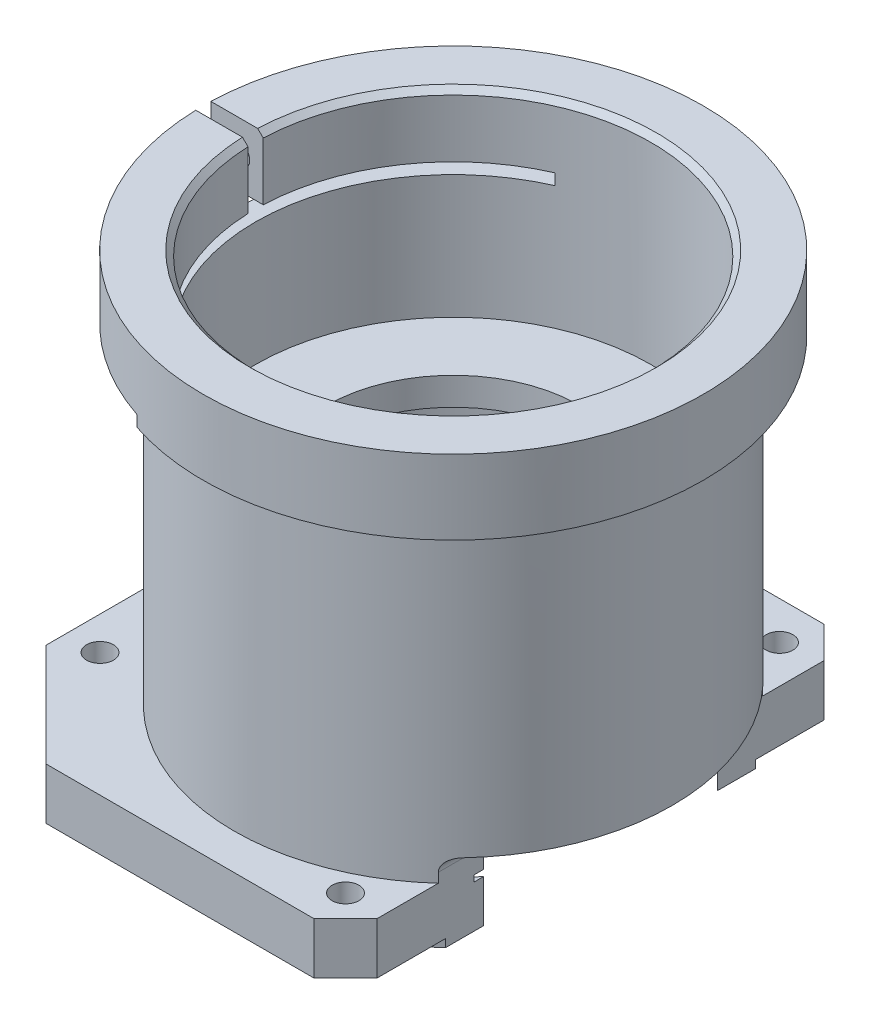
ISO-10303-21;
HEADER;
FILE_DESCRIPTION(('STEP AP214'),'2;1');
FILE_NAME('part.step','',(''),(''),'','','');
FILE_SCHEMA(('AUTOMOTIVE_DESIGN { 1 0 10303 214 1 1 1 1 }'));
ENDSEC;
DATA;
#1=APPLICATION_CONTEXT('core data for automotive mechanical design processes');
#2=APPLICATION_PROTOCOL_DEFINITION('international standard','automotive_design',2000,#1);
#3=PRODUCT_CONTEXT('',#1,'mechanical');
#4=PRODUCT('Part','Part','',(#3));
#5=PRODUCT_RELATED_PRODUCT_CATEGORY('part','',(#4));
#6=PRODUCT_DEFINITION_FORMATION('','',#4);
#7=PRODUCT_DEFINITION_CONTEXT('part definition',#1,'design');
#8=PRODUCT_DEFINITION('design','',#6,#7);
#9=PRODUCT_DEFINITION_SHAPE('','',#8);
#10=(LENGTH_UNIT() NAMED_UNIT(*) SI_UNIT(.MILLI.,.METRE.));
#11=(NAMED_UNIT(*) PLANE_ANGLE_UNIT() SI_UNIT($,.RADIAN.));
#12=(NAMED_UNIT(*) SI_UNIT($,.STERADIAN.) SOLID_ANGLE_UNIT());
#13=UNCERTAINTY_MEASURE_WITH_UNIT(LENGTH_MEASURE(1.E-05),#10,'distance_accuracy_value','');
#14=(GEOMETRIC_REPRESENTATION_CONTEXT(3) GLOBAL_UNCERTAINTY_ASSIGNED_CONTEXT((#13)) GLOBAL_UNIT_ASSIGNED_CONTEXT((#10,
#11,#12)) REPRESENTATION_CONTEXT('',''));
#15=CARTESIAN_POINT('',(0.,0.,0.));
#16=DIRECTION('',(0.,0.,1.));
#17=DIRECTION('',(1.,0.,0.));
#18=AXIS2_PLACEMENT_3D('',#15,#16,#17);
#19=CARTESIAN_POINT('',(0.,38.3208695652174,0.));
#20=DIRECTION('',(0.,1.,0.));
#21=DIRECTION('',(-1.,0.,0.));
#22=AXIS2_PLACEMENT_3D('',#19,#20,#21);
#23=CYLINDRICAL_SURFACE('',#22,30.1625);
#24=CARTESIAN_POINT('',(0.,-13.335,0.));
#25=DIRECTION('',(0.,1.,0.));
#26=DIRECTION('',(-1.,0.,0.));
#27=AXIS2_PLACEMENT_3D('',#24,#25,#26);
#28=CIRCLE('',#27,30.1625);
#29=CARTESIAN_POINT('',(-30.1625,-13.335,0.));
#30=VERTEX_POINT('',#29);
#31=EDGE_CURVE('E603',#30,#30,#28,.T.);
#32=ORIENTED_EDGE('',*,*,#31,.T.);
#33=EDGE_LOOP('',(#32));
#34=FACE_BOUND('',#33,.T.);
#35=DIRECTION('',(0.,1.,0.));
#36=VECTOR('',#35,1.);
#37=CARTESIAN_POINT('',(23.622,38.3208695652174,-18.7557330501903));
#38=LINE('',#37,#36);
#39=CARTESIAN_POINT('',(23.622,-38.735,-18.7557330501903));
#40=VERTEX_POINT('',#39);
#41=CARTESIAN_POINT('',(23.622,-41.9608,-18.7557330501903));
#42=VERTEX_POINT('',#41);
#43=EDGE_CURVE('E376',#40,#42,#38,.F.);
#44=ORIENTED_EDGE('',*,*,#43,.F.);
#45=CARTESIAN_POINT('',(23.622,-38.735,-18.7557330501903));
#46=CARTESIAN_POINT('',(23.6219878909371,-38.6929275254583,-18.7557468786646));
#47=CARTESIAN_POINT('',(23.6233062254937,-38.6508654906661,-18.7540878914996));
#48=CARTESIAN_POINT('',(23.6285104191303,-38.5671967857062,-18.7475313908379));
#49=CARTESIAN_POINT('',(23.6323936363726,-38.5255896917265,-18.7426372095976));
#50=CARTESIAN_POINT('',(23.6425813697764,-38.4436054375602,-18.7297841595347));
#51=CARTESIAN_POINT('',(23.6488603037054,-38.4032199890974,-18.7218576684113));
#52=CARTESIAN_POINT('',(23.6636785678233,-38.3235530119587,-18.7031245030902));
#53=CARTESIAN_POINT('',(23.6722183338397,-38.2842716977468,-18.6923172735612));
#54=CARTESIAN_POINT('',(23.7008741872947,-38.1688033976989,-18.6559887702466));
#55=CARTESIAN_POINT('',(23.7240798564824,-38.0945882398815,-18.6264942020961));
#56=CARTESIAN_POINT('',(23.7770870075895,-37.952696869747,-18.5587820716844));
#57=CARTESIAN_POINT('',(23.8069068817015,-37.8850396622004,-18.5205401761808));
#58=CARTESIAN_POINT('',(23.8872303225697,-37.7255768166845,-18.416914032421));
#59=CARTESIAN_POINT('',(23.9407457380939,-37.6380008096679,-18.3473676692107));
#60=CARTESIAN_POINT('',(24.0546620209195,-37.4776778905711,-18.1977614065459));
#61=CARTESIAN_POINT('',(24.1150750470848,-37.4049578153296,-18.1176829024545));
#62=CARTESIAN_POINT('',(24.2269112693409,-37.2866924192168,-17.967749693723));
#63=CARTESIAN_POINT('',(24.2775724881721,-37.2386444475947,-17.8992589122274));
#64=CARTESIAN_POINT('',(24.3805672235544,-37.1500674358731,-17.7587144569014));
#65=CARTESIAN_POINT('',(24.4329017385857,-37.1095429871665,-17.6866586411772));
#66=CARTESIAN_POINT('',(24.5387415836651,-37.0351700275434,-17.5395216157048));
#67=CARTESIAN_POINT('',(24.5922508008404,-37.0013492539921,-17.4644293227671));
#68=CARTESIAN_POINT('',(24.6997488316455,-36.9399344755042,-17.3120626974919));
#69=CARTESIAN_POINT('',(24.7537377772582,-36.9123422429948,-17.2347877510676));
#70=CARTESIAN_POINT('',(24.8799409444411,-36.8545314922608,-17.0523026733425));
#71=CARTESIAN_POINT('',(24.9521947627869,-36.8265358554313,-16.94641568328));
#72=CARTESIAN_POINT('',(25.0962697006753,-36.7795715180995,-16.7323139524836));
#73=CARTESIAN_POINT('',(25.1680905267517,-36.7606083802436,-16.624097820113));
#74=CARTESIAN_POINT('',(25.3096758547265,-36.7310993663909,-16.4077161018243));
#75=CARTESIAN_POINT('',(25.3794548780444,-36.7204238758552,-16.2995773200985));
#76=CARTESIAN_POINT('',(25.5177312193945,-36.7063932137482,-16.0822396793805));
#77=CARTESIAN_POINT('',(25.5862303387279,-36.7030268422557,-15.9730427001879));
#78=CARTESIAN_POINT('',(25.654,-36.703,-15.8634387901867));
#79=B_SPLINE_CURVE_WITH_KNOTS('',3,(#45,#46,#47,#48,#49,#50,#51,#52,#53,#54,#55,#56,#57,#58,#59,
#60,#61,#62,#63,#64,#65,#66,#67,#68,#69,#70,#71,#72,#73,#74,#75,#76,#77,#78),.UNSPECIFIED.,.F.,
.F.,(4,2,2,2,2,2,2,2,2,2,2,2,2,2,2,2,4),(0.,0.126147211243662,0.252164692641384,
0.37687256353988,0.501604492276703,0.749847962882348,0.998790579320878,1.36863195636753,
1.73913564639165,2.03215965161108,2.3253618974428,2.61975308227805,2.91422793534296,
3.30746594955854,3.70094582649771,4.08814045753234,4.47474136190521),.UNSPECIFIED.);
#80=CARTESIAN_POINT('',(25.654,-36.703,-15.8634387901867));
#81=VERTEX_POINT('',#80);
#82=EDGE_CURVE('E283',#40,#81,#79,.T.);
#83=ORIENTED_EDGE('',*,*,#82,.T.);
#84=CARTESIAN_POINT('',(0.,-36.703,0.));
#85=DIRECTION('',(0.,1.,0.));
#86=DIRECTION('',(0.,0.,1.));
#87=AXIS2_PLACEMENT_3D('',#84,#85,#86);
#88=CIRCLE('',#87,30.1625);
#89=CARTESIAN_POINT('',(25.654,-36.703,15.8634387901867));
#90=VERTEX_POINT('',#89);
#91=EDGE_CURVE('E251',#90,#81,#88,.T.);
#92=ORIENTED_EDGE('',*,*,#91,.F.);
#93=CARTESIAN_POINT('',(25.654,-36.703,15.8634387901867));
#94=CARTESIAN_POINT('',(25.6089697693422,-36.7030043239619,15.9362611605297));
#95=CARTESIAN_POINT('',(25.5636322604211,-36.704496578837,16.0088859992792));
#96=CARTESIAN_POINT('',(25.4723891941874,-36.7106145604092,16.1536720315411));
#97=CARTESIAN_POINT('',(25.4264834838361,-36.7152411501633,16.2258330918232));
#98=CARTESIAN_POINT('',(25.2875393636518,-36.7341232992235,16.4422081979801));
#99=CARTESIAN_POINT('',(25.193745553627,-36.7533846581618,16.5855515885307));
#100=CARTESIAN_POINT('',(25.004049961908,-36.8071980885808,16.8701946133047));
#101=CARTESIAN_POINT('',(24.9081363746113,-36.8419100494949,17.01145648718));
#102=CARTESIAN_POINT('',(24.7167144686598,-36.9290218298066,17.2883948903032));
#103=CARTESIAN_POINT('',(24.6212057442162,-36.9813755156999,17.4240849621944));
#104=CARTESIAN_POINT('',(24.4944744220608,-37.065854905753,17.6011444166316));
#105=CARTESIAN_POINT('',(24.4620837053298,-37.0887977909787,17.6461292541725));
#106=CARTESIAN_POINT('',(24.3977518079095,-37.1373485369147,17.7349687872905));
#107=CARTESIAN_POINT('',(24.3658106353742,-37.1629564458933,17.7788234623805));
#108=CARTESIAN_POINT('',(24.270967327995,-37.2439735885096,17.9083208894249));
#109=CARTESIAN_POINT('',(24.2089487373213,-37.3036390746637,17.9920318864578));
#110=CARTESIAN_POINT('',(24.0885467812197,-37.4363500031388,18.1529200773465));
#111=CARTESIAN_POINT('',(24.0302020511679,-37.5095133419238,18.230030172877));
#112=CARTESIAN_POINT('',(23.9205496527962,-37.670294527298,18.3736723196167));
#113=CARTESIAN_POINT('',(23.8692319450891,-37.757891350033,18.4402194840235));
#114=CARTESIAN_POINT('',(23.7917781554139,-37.9186169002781,18.5399676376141));
#115=CARTESIAN_POINT('',(23.762754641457,-37.987890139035,18.5771259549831));
#116=CARTESIAN_POINT('',(23.7117229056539,-38.1329613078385,18.6422185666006));
#117=CARTESIAN_POINT('',(23.6896945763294,-38.2087397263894,18.6701793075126));
#118=CARTESIAN_POINT('',(23.6639335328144,-38.3226831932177,18.7028025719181));
#119=CARTESIAN_POINT('',(23.6567685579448,-38.358871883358,18.711862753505));
#120=CARTESIAN_POINT('',(23.6443598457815,-38.4321023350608,18.7275399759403));
#121=CARTESIAN_POINT('',(23.6391157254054,-38.4691439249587,18.7341575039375));
#122=CARTESIAN_POINT('',(23.6306283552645,-38.5441447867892,18.7448622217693));
#123=CARTESIAN_POINT('',(23.6274025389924,-38.5821091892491,18.7489273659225));
#124=CARTESIAN_POINT('',(23.623083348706,-38.6583799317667,18.7543686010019));
#125=CARTESIAN_POINT('',(23.6219916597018,-38.6966865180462,18.7557425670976));
#126=CARTESIAN_POINT('',(23.622,-38.735,18.7557330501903));
#127=B_SPLINE_CURVE_WITH_KNOTS('',3,(#93,#94,#95,#96,#97,#98,#99,#100,#101,#102,#103,#104,#105,
#106,#107,#108,#109,#110,#111,#112,#113,#114,#115,#116,#117,#118,#119,#120,#121,#122,#123,#124,
#125,#126),.UNSPECIFIED.,.F.,.F.,(4,2,2,2,2,2,2,2,2,2,2,2,2,2,2,2,4),(0.,0.256830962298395,
0.513732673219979,1.0302189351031,1.55217898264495,2.07278455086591,2.25270474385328,
2.43262819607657,2.7919452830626,3.15456372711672,3.51665857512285,3.76721100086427,
4.01703656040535,4.13088756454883,4.24471585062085,4.35951424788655,4.47440324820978),.UNSPECIFIED.);
#128=CARTESIAN_POINT('',(23.622,-38.735,18.7557330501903));
#129=VERTEX_POINT('',#128);
#130=EDGE_CURVE('E47',#90,#129,#127,.T.);
#131=ORIENTED_EDGE('',*,*,#130,.T.);
#132=DIRECTION('',(0.,1.,0.));
#133=VECTOR('',#132,1.);
#134=CARTESIAN_POINT('',(23.622,38.3208695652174,18.7557330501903));
#135=LINE('',#134,#133);
#136=CARTESIAN_POINT('',(23.622,-41.9608,18.7557330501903));
#137=VERTEX_POINT('',#136);
#138=EDGE_CURVE('E436',#137,#129,#135,.T.);
#139=ORIENTED_EDGE('',*,*,#138,.F.);
#140=CARTESIAN_POINT('',(0.,-41.9608,0.));
#141=DIRECTION('',(0.,1.,0.));
#142=DIRECTION('',(0.,0.,1.));
#143=AXIS2_PLACEMENT_3D('',#140,#141,#142);
#144=CIRCLE('',#143,30.1625);
#145=EDGE_CURVE('E248',#42,#137,#144,.T.);
#146=ORIENTED_EDGE('',*,*,#145,.F.);
#147=EDGE_LOOP('',(#44,#83,#92,#131,#139,#146));
#148=FACE_BOUND('',#147,.T.);
#149=ADVANCED_FACE('F34',(#34,#148),#23,.F.);
#150=CARTESIAN_POINT('',(0.,-42.9514,0.));
#151=DIRECTION('',(0.,1.,0.));
#152=DIRECTION('',(0.,0.,1.));
#153=AXIS2_PLACEMENT_3D('',#150,#151,#152);
#154=CIRCLE('',#153,30.1625);
#155=CARTESIAN_POINT('',(23.622,-42.9514,-18.7557330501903));
#156=VERTEX_POINT('',#155);
#157=CARTESIAN_POINT('',(23.622,-42.9514,18.7557330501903));
#158=VERTEX_POINT('',#157);
#159=EDGE_CURVE('E1067',#156,#158,#154,.T.);
#160=ORIENTED_EDGE('',*,*,#159,.T.);
#161=DIRECTION('',(0.,1.,0.));
#162=VECTOR('',#161,1.);
#163=CARTESIAN_POINT('',(23.622,38.3208695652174,18.7557330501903));
#164=LINE('',#163,#162);
#165=CARTESIAN_POINT('',(23.622,-49.784,18.7557330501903));
#166=VERTEX_POINT('',#165);
#167=EDGE_CURVE('E438',#166,#158,#164,.T.);
#168=ORIENTED_EDGE('',*,*,#167,.F.);
#169=CARTESIAN_POINT('',(0.,-49.784,0.));
#170=DIRECTION('',(0.,-1.,0.));
#171=DIRECTION('',(1.,0.,0.));
#172=AXIS2_PLACEMENT_3D('',#169,#170,#171);
#173=CIRCLE('',#172,30.1625);
#174=CARTESIAN_POINT('',(23.622,-49.784,-18.7557330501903));
#175=VERTEX_POINT('',#174);
#176=EDGE_CURVE('E442',#166,#175,#173,.T.);
#177=ORIENTED_EDGE('',*,*,#176,.T.);
#178=EDGE_CURVE('E440',#156,#175,#38,.F.);
#179=ORIENTED_EDGE('',*,*,#178,.F.);
#180=EDGE_LOOP('',(#160,#168,#177,#179));
#181=FACE_BOUND('',#180,.T.);
#182=ADVANCED_FACE('F366',(#181),#23,.F.);
#183=CARTESIAN_POINT('',(-40.894,-48.514,-40.894));
#184=DIRECTION('',(0.,-1.,0.));
#185=DIRECTION('',(1.,0.,0.));
#186=AXIS2_PLACEMENT_3D('',#183,#184,#185);
#187=PLANE('',#186);
#188=CARTESIAN_POINT('',(17.526,-48.514,-34.798));
#189=DIRECTION('',(0.,-1.,0.));
#190=DIRECTION('',(1.,0.,0.));
#191=AXIS2_PLACEMENT_3D('',#188,#189,#190);
#192=CIRCLE('',#191,2.15264999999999);
#193=CARTESIAN_POINT('',(19.67865,-48.514,-34.798));
#194=VERTEX_POINT('',#193);
#195=EDGE_CURVE('E406',#194,#194,#192,.T.);
#196=ORIENTED_EDGE('',*,*,#195,.F.);
#197=EDGE_LOOP('',(#196));
#198=FACE_BOUND('',#197,.T.);
#199=CARTESIAN_POINT('',(-35.56,-48.514,-21.082));
#200=DIRECTION('',(0.,-1.,0.));
#201=DIRECTION('',(1.,0.,0.));
#202=AXIS2_PLACEMENT_3D('',#199,#200,#201);
#203=CIRCLE('',#202,2.15265);
#204=CARTESIAN_POINT('',(-33.40735,-48.514,-21.082));
#205=VERTEX_POINT('',#204);
#206=EDGE_CURVE('E412',#205,#205,#203,.T.);
#207=ORIENTED_EDGE('',*,*,#206,.F.);
#208=EDGE_LOOP('',(#207));
#209=FACE_BOUND('',#208,.T.);
#210=CARTESIAN_POINT('',(17.526,-48.514,34.798));
#211=DIRECTION('',(0.,-1.,0.));
#212=DIRECTION('',(1.,0.,0.));
#213=AXIS2_PLACEMENT_3D('',#210,#211,#212);
#214=CIRCLE('',#213,2.15264999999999);
#215=CARTESIAN_POINT('',(19.67865,-48.514,34.798));
#216=VERTEX_POINT('',#215);
#217=EDGE_CURVE('E418',#216,#216,#214,.T.);
#218=ORIENTED_EDGE('',*,*,#217,.F.);
#219=EDGE_LOOP('',(#218));
#220=FACE_BOUND('',#219,.T.);
#221=CARTESIAN_POINT('',(-35.56,-48.514,21.082));
#222=DIRECTION('',(0.,-1.,0.));
#223=DIRECTION('',(1.,0.,0.));
#224=AXIS2_PLACEMENT_3D('',#221,#222,#223);
#225=CIRCLE('',#224,2.15265);
#226=CARTESIAN_POINT('',(-33.40735,-48.514,21.082));
#227=VERTEX_POINT('',#226);
#228=EDGE_CURVE('E424',#227,#227,#225,.T.);
#229=ORIENTED_EDGE('',*,*,#228,.F.);
#230=EDGE_LOOP('',(#229));
#231=FACE_BOUND('',#230,.T.);
#232=DIRECTION('',(-1.,0.,0.));
#233=VECTOR('',#232,1.);
#234=CARTESIAN_POINT('',(-40.894,-48.514,40.894));
#235=LINE('',#234,#233);
#236=CARTESIAN_POINT('',(18.542,-48.514,40.894));
#237=VERTEX_POINT('',#236);
#238=CARTESIAN_POINT('',(-24.3839999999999,-48.514,40.894));
#239=VERTEX_POINT('',#238);
#240=EDGE_CURVE('E464',#237,#239,#235,.T.);
#241=ORIENTED_EDGE('',*,*,#240,.T.);
#242=DIRECTION('',(0.707106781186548,0.,0.707106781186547));
#243=VECTOR('',#242,1.);
#244=CARTESIAN_POINT('',(-73.533,-48.514,-8.25499999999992));
#245=LINE('',#244,#243);
#246=CARTESIAN_POINT('',(-40.894,-48.514,24.384));
#247=VERTEX_POINT('',#246);
#248=EDGE_CURVE('E555',#239,#247,#245,.F.);
#249=ORIENTED_EDGE('',*,*,#248,.T.);
#250=DIRECTION('',(0.,0.,-1.));
#251=VECTOR('',#250,1.);
#252=CARTESIAN_POINT('',(-40.894,-48.514,40.894));
#253=LINE('',#252,#251);
#254=CARTESIAN_POINT('',(-40.894,-48.514,-24.3839999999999));
#255=VERTEX_POINT('',#254);
#256=EDGE_CURVE('E459',#247,#255,#253,.T.);
#257=ORIENTED_EDGE('',*,*,#256,.T.);
#258=DIRECTION('',(-0.707106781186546,0.,0.707106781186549));
#259=VECTOR('',#258,1.);
#260=CARTESIAN_POINT('',(-32.639,-48.514,-32.639));
#261=LINE('',#260,#259);
#262=CARTESIAN_POINT('',(-24.384,-48.514,-40.894));
#263=VERTEX_POINT('',#262);
#264=EDGE_CURVE('E553',#255,#263,#261,.F.);
#265=ORIENTED_EDGE('',*,*,#264,.T.);
#266=DIRECTION('',(1.,0.,0.));
#267=VECTOR('',#266,1.);
#268=CARTESIAN_POINT('',(-40.894,-48.514,-40.894));
#269=LINE('',#268,#267);
#270=CARTESIAN_POINT('',(18.542,-48.514,-40.894));
#271=VERTEX_POINT('',#270);
#272=EDGE_CURVE('E462',#263,#271,#269,.T.);
#273=ORIENTED_EDGE('',*,*,#272,.T.);
#274=DIRECTION('',(-0.70710678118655,0.,-0.707106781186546));
#275=VECTOR('',#274,1.);
#276=CARTESIAN_POINT('',(-11.1760000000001,-48.514,-70.612));
#277=LINE('',#276,#275);
#278=CARTESIAN_POINT('',(23.622,-48.514,-35.814));
#279=VERTEX_POINT('',#278);
#280=EDGE_CURVE('E534',#271,#279,#277,.F.);
#281=ORIENTED_EDGE('',*,*,#280,.T.);
#282=DIRECTION('',(0.,0.,-1.));
#283=VECTOR('',#282,1.);
#284=CARTESIAN_POINT('',(23.622,-48.514,-40.894));
#285=LINE('',#284,#283);
#286=CARTESIAN_POINT('',(23.622,-48.514,-24.8556877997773));
#287=VERTEX_POINT('',#286);
#288=EDGE_CURVE('E433',#287,#279,#285,.T.);
#289=ORIENTED_EDGE('',*,*,#288,.F.);
#290=CARTESIAN_POINT('',(0.,-48.514,0.));
#291=DIRECTION('',(0.,-1.,0.));
#292=DIRECTION('',(1.,0.,0.));
#293=AXIS2_PLACEMENT_3D('',#290,#291,#292);
#294=CIRCLE('',#293,34.29);
#295=CARTESIAN_POINT('',(23.622,-48.514,24.8556877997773));
#296=VERTEX_POINT('',#295);
#297=EDGE_CURVE('E445',#296,#287,#294,.T.);
#298=ORIENTED_EDGE('',*,*,#297,.F.);
#299=CARTESIAN_POINT('',(23.622,-48.514,35.814));
#300=VERTEX_POINT('',#299);
#301=EDGE_CURVE('E435',#300,#296,#285,.T.);
#302=ORIENTED_EDGE('',*,*,#301,.F.);
#303=DIRECTION('',(0.707106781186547,0.,-0.707106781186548));
#304=VECTOR('',#303,1.);
#305=CARTESIAN_POINT('',(29.7180000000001,-48.514,29.7179999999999));
#306=LINE('',#305,#304);
#307=EDGE_CURVE('E532',#300,#237,#306,.F.);
#308=ORIENTED_EDGE('',*,*,#307,.T.);
#309=EDGE_LOOP('',(#241,#249,#257,#265,#273,#281,#289,#298,#302,#308));
#310=FACE_BOUND('',#309,.T.);
#311=ADVANCED_FACE('F893',(#198,#209,#220,#231,#310),#187,.T.);
#312=CARTESIAN_POINT('',(0.,0.,0.));
#313=DIRECTION('',(0.,1.,0.));
#314=DIRECTION('',(0.,0.,1.));
#315=AXIS2_PLACEMENT_3D('',#312,#313,#314);
#316=CYLINDRICAL_SURFACE('',#315,35.13963);
#317=CARTESIAN_POINT('',(0.,-40.259,0.));
#318=DIRECTION('',(0.,-1.,0.));
#319=DIRECTION('',(1.,0.,0.));
#320=AXIS2_PLACEMENT_3D('',#317,#318,#319);
#321=CIRCLE('',#320,35.13963);
#322=CARTESIAN_POINT('',(23.622,-40.259,26.0152784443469));
#323=VERTEX_POINT('',#322);
#324=CARTESIAN_POINT('',(23.622,-40.259,-26.0152784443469));
#325=VERTEX_POINT('',#324);
#326=EDGE_CURVE('E512',#323,#325,#321,.T.);
#327=ORIENTED_EDGE('',*,*,#326,.F.);
#328=DIRECTION('',(0.,1.,0.));
#329=VECTOR('',#328,1.);
#330=CARTESIAN_POINT('',(23.622,0.,26.0152784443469));
#331=LINE('',#330,#329);
#332=CARTESIAN_POINT('',(23.622,-38.735,26.0152784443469));
#333=VERTEX_POINT('',#332);
#334=EDGE_CURVE('E395',#323,#333,#331,.T.);
#335=ORIENTED_EDGE('',*,*,#334,.T.);
#336=CARTESIAN_POINT('',(23.622,-38.735,26.0152784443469));
#337=CARTESIAN_POINT('',(23.6219893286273,-38.6884945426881,26.0152870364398));
#338=CARTESIAN_POINT('',(23.6235961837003,-38.641996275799,26.0138290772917));
#339=CARTESIAN_POINT('',(23.6299631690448,-38.5494232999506,26.0080462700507));
#340=CARTESIAN_POINT('',(23.63472136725,-38.5033483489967,26.0037231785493));
#341=CARTESIAN_POINT('',(23.6472643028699,-38.4123009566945,25.9923172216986));
#342=CARTESIAN_POINT('',(23.6550270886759,-38.3673229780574,25.98525437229));
#343=CARTESIAN_POINT('',(23.6734280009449,-38.2784693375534,25.9684916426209));
#344=CARTESIAN_POINT('',(23.6840664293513,-38.2345937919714,25.9587914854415));
#345=CARTESIAN_POINT('',(23.7199824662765,-38.1052618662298,25.925992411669));
#346=CARTESIAN_POINT('',(23.7493012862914,-38.0218176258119,25.8991583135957));
#347=CARTESIAN_POINT('',(23.8169948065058,-37.8620714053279,25.836920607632));
#348=CARTESIAN_POINT('',(23.8553863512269,-37.7857830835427,25.801501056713));
#349=CARTESIAN_POINT('',(23.9540225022,-37.6161768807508,25.7100043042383));
#350=CARTESIAN_POINT('',(24.0172266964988,-37.5261410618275,25.6510243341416));
#351=CARTESIAN_POINT('',(24.1528699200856,-37.3612907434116,25.5233459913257));
#352=CARTESIAN_POINT('',(24.225322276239,-37.2864986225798,25.4546335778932));
#353=CARTESIAN_POINT('',(24.4034203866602,-37.1275255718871,25.284120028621));
#354=CARTESIAN_POINT('',(24.511670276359,-37.0495532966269,25.179273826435));
#355=CARTESIAN_POINT('',(24.7343131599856,-36.9184210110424,24.9606055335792));
#356=CARTESIAN_POINT('',(24.8487231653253,-36.865334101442,24.8467581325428));
#357=CARTESIAN_POINT('',(25.0215835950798,-36.802959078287,24.6722646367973));
#358=CARTESIAN_POINT('',(25.0792046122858,-36.7850765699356,24.6136941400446));
#359=CARTESIAN_POINT('',(25.1947358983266,-36.7546795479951,24.4954220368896));
#360=CARTESIAN_POINT('',(25.2526462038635,-36.7421657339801,24.4357202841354));
#361=CARTESIAN_POINT('',(25.3679635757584,-36.7223891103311,24.3159797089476));
#362=CARTESIAN_POINT('',(25.4253707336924,-36.7150825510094,24.2559480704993));
#363=CARTESIAN_POINT('',(25.5399265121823,-36.705392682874,24.1352997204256));
#364=CARTESIAN_POINT('',(25.5970752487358,-36.7030068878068,24.0746833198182));
#365=CARTESIAN_POINT('',(25.654,-36.703,24.0138685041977));
#366=B_SPLINE_CURVE_WITH_KNOTS('',3,(#336,#337,#338,#339,#340,#341,#342,#343,#344,#345,#346,
#347,#348,#349,#350,#351,#352,#353,#354,#355,#356,#357,#358,#359,#360,#361,#362,#363,#364,#365),
.UNSPECIFIED.,.F.,.F.,(4,2,2,2,2,2,2,2,2,2,2,2,2,2,4),(0.,0.139454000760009,0.27882258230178,
0.417191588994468,0.555575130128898,0.831490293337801,1.1079218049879,1.48031751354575,
1.85325604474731,2.35957298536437,2.86736805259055,3.11948214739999,3.37162908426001,
3.62163175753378,3.87150808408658),.UNSPECIFIED.);
#367=CARTESIAN_POINT('',(25.654,-36.703,24.0138685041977));
#368=VERTEX_POINT('',#367);
#369=EDGE_CURVE('E11',#333,#368,#366,.T.);
#370=ORIENTED_EDGE('',*,*,#369,.T.);
#371=CARTESIAN_POINT('',(0.,-36.703,0.));
#372=DIRECTION('',(0.,1.,0.));
#373=DIRECTION('',(0.,0.,1.));
#374=AXIS2_PLACEMENT_3D('',#371,#372,#373);
#375=CIRCLE('',#374,35.13963);
#376=CARTESIAN_POINT('',(25.654,-36.703,-24.0138685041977));
#377=VERTEX_POINT('',#376);
#378=EDGE_CURVE('E388',#368,#377,#375,.T.);
#379=ORIENTED_EDGE('',*,*,#378,.T.);
#380=CARTESIAN_POINT('',(25.654,-36.703,-24.0138685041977));
#381=CARTESIAN_POINT('',(25.5775808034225,-36.7030217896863,-24.0955147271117));
#382=CARTESIAN_POINT('',(25.5007390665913,-36.7073136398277,-24.1768160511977));
#383=CARTESIAN_POINT('',(25.3466187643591,-36.7248769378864,-24.3383422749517));
#384=CARTESIAN_POINT('',(25.2693396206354,-36.738167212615,-24.418564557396));
#385=CARTESIAN_POINT('',(25.1142404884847,-36.7743658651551,-24.5780602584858));
#386=CARTESIAN_POINT('',(25.0364237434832,-36.797377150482,-24.6573139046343));
#387=CARTESIAN_POINT('',(24.8819657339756,-36.8535812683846,-24.8131700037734));
#388=CARTESIAN_POINT('',(24.8053234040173,-36.8867642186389,-24.8897749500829));
#389=CARTESIAN_POINT('',(24.6316612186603,-36.9754614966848,-25.0618006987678));
#390=CARTESIAN_POINT('',(24.5353377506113,-37.0346799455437,-25.1560653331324));
#391=CARTESIAN_POINT('',(24.3494863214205,-37.1727574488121,-25.335997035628));
#392=CARTESIAN_POINT('',(24.2599343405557,-37.2515423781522,-25.4216948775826));
#393=CARTESIAN_POINT('',(24.1100110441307,-37.4104959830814,-25.5638264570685));
#394=CARTESIAN_POINT('',(24.0475385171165,-37.4866032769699,-25.622563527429));
#395=CARTESIAN_POINT('',(23.9319184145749,-37.6516812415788,-25.7305872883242));
#396=CARTESIAN_POINT('',(23.8787641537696,-37.7406426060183,-25.7798807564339));
#397=CARTESIAN_POINT('',(23.7935932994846,-37.9131622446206,-25.8584852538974));
#398=CARTESIAN_POINT('',(23.7594914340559,-37.994773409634,-25.889799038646));
#399=CARTESIAN_POINT('',(23.70168075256,-38.1644970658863,-25.9427343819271));
#400=CARTESIAN_POINT('',(23.6779522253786,-38.2525968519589,-25.9643743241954));
#401=CARTESIAN_POINT('',(23.6476491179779,-38.4066507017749,-25.9919716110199));
#402=CARTESIAN_POINT('',(23.6380871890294,-38.4715454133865,-26.0006646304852));
#403=CARTESIAN_POINT('',(23.6252373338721,-38.6026055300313,-26.0123389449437));
#404=CARTESIAN_POINT('',(23.6219637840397,-38.6687734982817,-26.0153071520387));
#405=CARTESIAN_POINT('',(23.622,-38.735,-26.0152784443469));
#406=B_SPLINE_CURVE_WITH_KNOTS('',3,(#380,#381,#382,#383,#384,#385,#386,#387,#388,#389,#390,
#391,#392,#393,#394,#395,#396,#397,#398,#399,#400,#401,#402,#403,#404,#405),.UNSPECIFIED.,.F.,
.F.,(4,2,2,2,2,2,2,2,2,2,2,2,4),(0.,0.335463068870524,0.671630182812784,1.01144887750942,
1.35093846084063,1.79109380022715,2.22960644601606,2.57233269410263,2.91481204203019,
3.19516728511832,3.47498746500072,3.6729651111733,3.87139483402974),.UNSPECIFIED.);
#407=CARTESIAN_POINT('',(23.622,-38.735,-26.0152784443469));
#408=VERTEX_POINT('',#407);
#409=EDGE_CURVE('E277',#377,#408,#406,.T.);
#410=ORIENTED_EDGE('',*,*,#409,.T.);
#411=DIRECTION('',(0.,1.,0.));
#412=VECTOR('',#411,1.);
#413=CARTESIAN_POINT('',(23.622,0.,-26.0152784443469));
#414=LINE('',#413,#412);
#415=EDGE_CURVE('E386',#408,#325,#414,.F.);
#416=ORIENTED_EDGE('',*,*,#415,.T.);
#417=EDGE_LOOP('',(#327,#335,#370,#379,#410,#416));
#418=FACE_BOUND('',#417,.T.);
#419=CARTESIAN_POINT('',(0.,10.922,0.));
#420=DIRECTION('',(0.,1.,0.));
#421=DIRECTION('',(0.,0.,1.));
#422=AXIS2_PLACEMENT_3D('',#419,#420,#421);
#423=CIRCLE('',#422,35.13963);
#424=CARTESIAN_POINT('',(-12.7,10.922,-32.7643647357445));
#425=VERTEX_POINT('',#424);
#426=CARTESIAN_POINT('',(-12.7,10.922,32.7643647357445));
#427=VERTEX_POINT('',#426);
#428=EDGE_CURVE('E471',#425,#427,#423,.T.);
#429=ORIENTED_EDGE('',*,*,#428,.F.);
#430=EDGE_CURVE('E470',#427,#425,#423,.T.);
#431=ORIENTED_EDGE('',*,*,#430,.F.);
#432=EDGE_LOOP('',(#429,#431));
#433=FACE_BOUND('',#432,.T.);
#434=ADVANCED_FACE('F288',(#418,#433),#316,.T.);
#435=CARTESIAN_POINT('',(-31.71063,22.86,0.));
#436=DIRECTION('',(0.,1.,0.));
#437=DIRECTION('',(-1.,0.,0.));
#438=AXIS2_PLACEMENT_3D('',#435,#436,#437);
#439=PLANE('',#438);
#440=DIRECTION('',(-1.,0.,0.));
#441=VECTOR('',#440,1.);
#442=CARTESIAN_POINT('',(-27.7991487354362,22.86,-1.2192));
#443=LINE('',#442,#441);
#444=CARTESIAN_POINT('',(-32.5768234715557,22.86,-1.2192));
#445=VERTEX_POINT('',#444);
#446=CARTESIAN_POINT('',(-40.0740880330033,22.86,-1.2192));
#447=VERTEX_POINT('',#446);
#448=EDGE_CURVE('E574',#445,#447,#443,.T.);
#449=ORIENTED_EDGE('',*,*,#448,.F.);
#450=CARTESIAN_POINT('',(0.,22.86,0.));
#451=DIRECTION('',(0.,1.,0.));
#452=DIRECTION('',(-1.,0.,0.));
#453=AXIS2_PLACEMENT_3D('',#450,#451,#452);
#454=CIRCLE('',#453,32.59963);
#455=CARTESIAN_POINT('',(-32.5768234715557,22.86,1.2192));
#456=VERTEX_POINT('',#455);
#457=EDGE_CURVE('E334',#445,#456,#454,.F.);
#458=ORIENTED_EDGE('',*,*,#457,.T.);
#459=DIRECTION('',(1.,0.,0.));
#460=VECTOR('',#459,1.);
#461=CARTESIAN_POINT('',(-27.7991487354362,22.86,1.2192));
#462=LINE('',#461,#460);
#463=CARTESIAN_POINT('',(-40.0740880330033,22.86,1.2192));
#464=VERTEX_POINT('',#463);
#465=EDGE_CURVE('E572',#464,#456,#462,.T.);
#466=ORIENTED_EDGE('',*,*,#465,.F.);
#467=CARTESIAN_POINT('',(0.,22.86,0.));
#468=DIRECTION('',(0.,1.,0.));
#469=DIRECTION('',(-1.,0.,0.));
#470=AXIS2_PLACEMENT_3D('',#467,#468,#469);
#471=CIRCLE('',#470,40.09263);
#472=EDGE_CURVE('E606',#464,#447,#471,.T.);
#473=ORIENTED_EDGE('',*,*,#472,.T.);
#474=EDGE_LOOP('',(#449,#458,#466,#473));
#475=FACE_BOUND('',#474,.T.);
#476=ADVANCED_FACE('F36',(#475),#439,.T.);
#477=CARTESIAN_POINT('',(0.,38.3208695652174,0.));
#478=DIRECTION('',(0.,1.,0.));
#479=DIRECTION('',(-1.,0.,0.));
#480=AXIS2_PLACEMENT_3D('',#477,#478,#479);
#481=CYLINDRICAL_SURFACE('',#480,40.09263);
#482=CARTESIAN_POINT('',(0.,10.922,0.));
#483=DIRECTION('',(0.,1.,0.));
#484=DIRECTION('',(0.,0.,1.));
#485=AXIS2_PLACEMENT_3D('',#482,#483,#484);
#486=CIRCLE('',#485,40.09263);
#487=CARTESIAN_POINT('',(-12.7,10.922,38.0280025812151));
#488=VERTEX_POINT('',#487);
#489=CARTESIAN_POINT('',(-12.7,10.922,-38.0280025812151));
#490=VERTEX_POINT('',#489);
#491=EDGE_CURVE('E467',#488,#490,#486,.T.);
#492=ORIENTED_EDGE('',*,*,#491,.T.);
#493=DIRECTION('',(0.,1.,0.));
#494=VECTOR('',#493,1.);
#495=CARTESIAN_POINT('',(-12.7,38.3208695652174,-38.0280025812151));
#496=LINE('',#495,#494);
#497=CARTESIAN_POINT('',(-12.7,12.7,-38.0280025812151));
#498=VERTEX_POINT('',#497);
#499=EDGE_CURVE('E584',#498,#490,#496,.F.);
#500=ORIENTED_EDGE('',*,*,#499,.F.);
#501=CARTESIAN_POINT('',(0.,12.7,0.));
#502=DIRECTION('',(0.,1.,0.));
#503=DIRECTION('',(0.,0.,1.));
#504=AXIS2_PLACEMENT_3D('',#501,#502,#503);
#505=CIRCLE('',#504,40.09263);
#506=CARTESIAN_POINT('',(-40.0740880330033,12.7,-1.2192));
#507=VERTEX_POINT('',#506);
#508=EDGE_CURVE('E644',#507,#498,#505,.F.);
#509=ORIENTED_EDGE('',*,*,#508,.F.);
#510=DIRECTION('',(0.,1.,0.));
#511=VECTOR('',#510,1.);
#512=CARTESIAN_POINT('',(-40.0740880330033,38.3208695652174,-1.2192));
#513=LINE('',#512,#511);
#514=EDGE_CURVE('E590',#447,#507,#513,.F.);
#515=ORIENTED_EDGE('',*,*,#514,.F.);
#516=ORIENTED_EDGE('',*,*,#472,.F.);
#517=DIRECTION('',(0.,1.,0.));
#518=VECTOR('',#517,1.);
#519=CARTESIAN_POINT('',(-40.0740880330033,38.3208695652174,1.2192));
#520=LINE('',#519,#518);
#521=CARTESIAN_POINT('',(-40.0740880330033,12.7,1.2192));
#522=VERTEX_POINT('',#521);
#523=EDGE_CURVE('E579',#522,#464,#520,.T.);
#524=ORIENTED_EDGE('',*,*,#523,.F.);
#525=CARTESIAN_POINT('',(-12.7,12.7,38.0280025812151));
#526=VERTEX_POINT('',#525);
#527=EDGE_CURVE('E647',#526,#522,#505,.F.);
#528=ORIENTED_EDGE('',*,*,#527,.F.);
#529=DIRECTION('',(0.,1.,0.));
#530=VECTOR('',#529,1.);
#531=CARTESIAN_POINT('',(-12.7,38.3208695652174,38.0280025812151));
#532=LINE('',#531,#530);
#533=EDGE_CURVE('E648',#488,#526,#532,.T.);
#534=ORIENTED_EDGE('',*,*,#533,.F.);
#535=EDGE_LOOP('',(#492,#500,#509,#515,#516,#524,#528,#534));
#536=FACE_BOUND('',#535,.T.);
#537=CARTESIAN_POINT('',(-33.8613358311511,17.78,-21.4669260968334));
#538=CARTESIAN_POINT('',(-33.8613369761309,17.7156849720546,-21.4669243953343));
#539=CARTESIAN_POINT('',(-33.8644359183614,17.6513593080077,-21.4620384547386));
#540=CARTESIAN_POINT('',(-33.8765297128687,17.5246753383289,-21.4429437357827));
#541=CARTESIAN_POINT('',(-33.8855289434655,17.4623185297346,-21.428728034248));
#542=CARTESIAN_POINT('',(-33.9085660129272,17.3415075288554,-21.3922552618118));
#543=CARTESIAN_POINT('',(-33.9225701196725,17.2830302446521,-21.3700520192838));
#544=CARTESIAN_POINT('',(-33.9546829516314,17.1703128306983,-21.3189915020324));
#545=CARTESIAN_POINT('',(-33.9727930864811,17.1160741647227,-21.2901319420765));
#546=CARTESIAN_POINT('',(-34.0255211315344,16.9770063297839,-21.2058182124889));
#547=CARTESIAN_POINT('',(-34.0630378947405,16.8962005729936,-21.1455500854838));
#548=CARTESIAN_POINT('',(-34.1437945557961,16.746443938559,-21.0149044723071));
#549=CARTESIAN_POINT('',(-34.1870522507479,16.67753152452,-20.94449548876));
#550=CARTESIAN_POINT('',(-34.2703887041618,16.5597263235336,-20.8078081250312));
#551=CARTESIAN_POINT('',(-34.3099873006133,16.5093802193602,-20.742466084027));
#552=CARTESIAN_POINT('',(-34.3908882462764,16.4154223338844,-20.6080553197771));
#553=CARTESIAN_POINT('',(-34.4321918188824,16.3718154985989,-20.5389839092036));
#554=CARTESIAN_POINT('',(-34.5159171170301,16.2905293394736,-20.3979700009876));
#555=CARTESIAN_POINT('',(-34.5583401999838,16.2528576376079,-20.3260239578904));
#556=CARTESIAN_POINT('',(-34.643840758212,16.1828272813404,-20.1799517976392));
#557=CARTESIAN_POINT('',(-34.6869184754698,16.1504706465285,-20.1058248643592));
#558=CARTESIAN_POINT('',(-34.8122192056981,16.0635920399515,-19.888571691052));
#559=CARTESIAN_POINT('',(-34.8948809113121,16.0152352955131,-19.7432196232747));
#560=CARTESIAN_POINT('',(-35.0600367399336,15.9326496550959,-19.4484302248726));
#561=CARTESIAN_POINT('',(-35.1425306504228,15.8984332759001,-19.2989893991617));
#562=CARTESIAN_POINT('',(-35.3066423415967,15.842052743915,-18.9970932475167));
#563=CARTESIAN_POINT('',(-35.388258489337,15.819908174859,-18.8446334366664));
#564=CARTESIAN_POINT('',(-35.5499891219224,15.786242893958,-18.5377280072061));
#565=CARTESIAN_POINT('',(-35.6301031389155,15.7747254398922,-18.3832817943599));
#566=CARTESIAN_POINT('',(-35.7756045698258,15.7623362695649,-18.0982426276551));
#567=CARTESIAN_POINT('',(-35.8412706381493,15.7600394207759,-17.9678493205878));
#568=CARTESIAN_POINT('',(-35.9711644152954,15.7616846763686,-17.7063723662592));
#569=CARTESIAN_POINT('',(-36.0353919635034,15.7656274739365,-17.5752886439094));
#570=CARTESIAN_POINT('',(-36.1623491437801,15.7794273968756,-17.3125616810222));
#571=CARTESIAN_POINT('',(-36.2250773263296,15.789290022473,-17.1809180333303));
#572=CARTESIAN_POINT('',(-36.3488859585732,15.81472434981,-16.9174070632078));
#573=CARTESIAN_POINT('',(-36.4099663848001,15.8302961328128,-16.78553973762));
#574=CARTESIAN_POINT('',(-36.5306005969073,15.8671202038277,-16.5213605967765));
#575=CARTESIAN_POINT('',(-36.5901486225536,15.8883912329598,-16.3890487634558));
#576=CARTESIAN_POINT('',(-36.707422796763,15.9366291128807,-16.1246705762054));
#577=CARTESIAN_POINT('',(-36.7651491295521,15.9635953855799,-15.9926041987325));
#578=CARTESIAN_POINT('',(-36.8786363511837,16.0233902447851,-15.7291356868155));
#579=CARTESIAN_POINT('',(-36.9343994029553,16.0562121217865,-15.5977329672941));
#580=CARTESIAN_POINT('',(-37.0439119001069,16.1281360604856,-15.335830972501));
#581=CARTESIAN_POINT('',(-37.0976617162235,16.1672369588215,-15.2053315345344));
#582=CARTESIAN_POINT('',(-37.2017652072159,16.2514161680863,-14.9487907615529));
#583=CARTESIAN_POINT('',(-37.2521690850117,16.2963317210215,-14.8227168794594));
#584=CARTESIAN_POINT('',(-37.3507486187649,16.393940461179,-14.5725308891));
#585=CARTESIAN_POINT('',(-37.3989218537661,16.4466418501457,-14.4484210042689));
#586=CARTESIAN_POINT('',(-37.4922276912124,16.5610740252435,-14.2045307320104));
#587=CARTESIAN_POINT('',(-37.537382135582,16.6227265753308,-14.084723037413));
#588=CARTESIAN_POINT('',(-37.6025026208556,16.7243740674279,-13.9095173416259));
#589=CARTESIAN_POINT('',(-37.6237555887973,16.7597473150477,-13.8519181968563));
#590=CARTESIAN_POINT('',(-37.6652243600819,16.8341488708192,-13.738758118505));
#591=CARTESIAN_POINT('',(-37.6854406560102,16.8731754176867,-13.6831962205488));
#592=CARTESIAN_POINT('',(-37.7260895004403,16.9588442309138,-13.570740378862));
#593=CARTESIAN_POINT('',(-37.7464176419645,17.0058421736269,-13.5140762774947));
#594=CARTESIAN_POINT('',(-37.7849938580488,17.1062850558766,-13.4058382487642));
#595=CARTESIAN_POINT('',(-37.8032428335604,17.1597271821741,-13.3542621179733));
#596=CARTESIAN_POINT('',(-37.8317979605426,17.258125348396,-13.2731058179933));
#597=CARTESIAN_POINT('',(-37.8428816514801,17.3011245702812,-13.2414577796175));
#598=CARTESIAN_POINT('',(-37.862775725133,17.3916318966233,-13.1844643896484));
#599=CARTESIAN_POINT('',(-37.871590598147,17.4391308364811,-13.1591065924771));
#600=CARTESIAN_POINT('',(-37.8841582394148,17.5253713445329,-13.1228733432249));
#601=CARTESIAN_POINT('',(-37.8886326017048,17.5631315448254,-13.1099430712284));
#602=CARTESIAN_POINT('',(-37.8954754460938,17.6403892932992,-13.0901502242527));
#603=CARTESIAN_POINT('',(-37.897846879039,17.6798843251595,-13.0832791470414));
#604=CARTESIAN_POINT('',(-37.9002311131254,17.7597635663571,-13.0763709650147));
#605=CARTESIAN_POINT('',(-37.9002317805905,17.8001512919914,-13.0763690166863));
#606=CARTESIAN_POINT('',(-37.897844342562,17.8802634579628,-13.083286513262));
#607=CARTESIAN_POINT('',(-37.8954543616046,17.9199873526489,-13.0902113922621));
#608=CARTESIAN_POINT('',(-37.8879502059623,18.0044075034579,-13.1119166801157));
#609=CARTESIAN_POINT('',(-37.8824339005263,18.0487640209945,-13.1278556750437));
#610=CARTESIAN_POINT('',(-37.8691065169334,18.1341687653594,-13.1662509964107));
#611=CARTESIAN_POINT('',(-37.8612910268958,18.1752104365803,-13.1887198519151));
#612=CARTESIAN_POINT('',(-37.8384169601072,18.2790400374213,-13.2542450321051));
#613=CARTESIAN_POINT('',(-37.8219216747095,18.3389612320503,-13.301281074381));
#614=CARTESIAN_POINT('',(-37.7860690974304,18.451096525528,-13.4027945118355));
#615=CARTESIAN_POINT('',(-37.7667029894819,18.5032858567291,-13.4572947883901));
#616=CARTESIAN_POINT('',(-37.7191154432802,18.6182433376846,-13.5902105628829));
#617=CARTESIAN_POINT('',(-37.690125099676,18.6785568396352,-13.6704473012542));
#618=CARTESIAN_POINT('',(-37.6297787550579,18.7910051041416,-13.8356975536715));
#619=CARTESIAN_POINT('',(-37.5984182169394,18.8431235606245,-13.9207201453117));
#620=CARTESIAN_POINT('',(-37.5337710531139,18.941107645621,-14.0940983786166));
#621=CARTESIAN_POINT('',(-37.5004765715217,18.9869448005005,-14.1824670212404));
#622=CARTESIAN_POINT('',(-37.4324282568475,19.0732617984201,-14.3611083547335));
#623=CARTESIAN_POINT('',(-37.3976755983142,19.1137458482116,-14.4513794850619));
#624=CARTESIAN_POINT('',(-37.3243051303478,19.1929805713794,-14.6398832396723));
#625=CARTESIAN_POINT('',(-37.2855896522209,19.2313935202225,-14.7382190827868));
#626=CARTESIAN_POINT('',(-37.2068015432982,19.3037158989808,-14.9360050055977));
#627=CARTESIAN_POINT('',(-37.1667286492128,19.3376244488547,-15.035455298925));
#628=CARTESIAN_POINT('',(-37.0445553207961,19.4333642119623,-15.3351366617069));
#629=CARTESIAN_POINT('',(-36.9605596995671,19.4891473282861,-15.536545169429));
#630=CARTESIAN_POINT('',(-36.7879826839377,19.5866804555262,-15.9408819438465));
#631=CARTESIAN_POINT('',(-36.6993983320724,19.6284212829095,-16.1438111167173));
#632=CARTESIAN_POINT('',(-36.5180317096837,19.6985261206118,-16.5499781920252));
#633=CARTESIAN_POINT('',(-36.4252515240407,19.7268966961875,-16.7532158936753));
#634=CARTESIAN_POINT('',(-36.2180368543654,19.7742540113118,-17.1971938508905));
#635=CARTESIAN_POINT('',(-36.1027929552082,19.7905007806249,-17.4378533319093));
#636=CARTESIAN_POINT('',(-35.8671475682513,19.8027048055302,-17.9175363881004));
#637=CARTESIAN_POINT('',(-35.7467414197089,19.7986433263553,-18.1565582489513));
#638=CARTESIAN_POINT('',(-35.5631278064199,19.7751304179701,-18.5121781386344));
#639=CARTESIAN_POINT('',(-35.501452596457,19.7643985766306,-18.6301771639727));
#640=CARTESIAN_POINT('',(-35.3772498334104,19.7365862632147,-18.8649620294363));
#641=CARTESIAN_POINT('',(-35.3147224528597,19.719507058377,-18.9817481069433));
#642=CARTESIAN_POINT('',(-35.1891328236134,19.6783561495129,-19.2135698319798));
#643=CARTESIAN_POINT('',(-35.1260715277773,19.6542950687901,-19.3286078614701));
#644=CARTESIAN_POINT('',(-34.9996669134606,19.5983084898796,-19.5565657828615));
#645=CARTESIAN_POINT('',(-34.9363237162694,19.5663861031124,-19.6694864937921));
#646=CARTESIAN_POINT('',(-34.8166290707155,19.4974699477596,-19.8805032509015));
#647=CARTESIAN_POINT('',(-34.7602594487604,19.4613928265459,-19.978885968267));
#648=CARTESIAN_POINT('',(-34.6481277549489,19.3810185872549,-20.1727230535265));
#649=CARTESIAN_POINT('',(-34.5923660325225,19.3367169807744,-20.268175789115));
#650=CARTESIAN_POINT('',(-34.4826518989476,19.2389638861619,-20.4542728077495));
#651=CARTESIAN_POINT('',(-34.4286891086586,19.1855829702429,-20.5449475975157));
#652=CARTESIAN_POINT('',(-34.3233583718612,19.0679017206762,-20.7204360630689));
#653=CARTESIAN_POINT('',(-34.2719860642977,19.0036205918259,-20.8052596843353));
#654=CARTESIAN_POINT('',(-34.186917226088,18.8812879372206,-20.9446518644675));
#655=CARTESIAN_POINT('',(-34.1521919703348,18.8262368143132,-21.0012076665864));
#656=CARTESIAN_POINT('',(-34.0861477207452,18.7084125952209,-21.1082321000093));
#657=CARTESIAN_POINT('',(-34.0548327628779,18.6456305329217,-21.1586935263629));
#658=CARTESIAN_POINT('',(-33.9968808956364,18.5110755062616,-21.251684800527));
#659=CARTESIAN_POINT('',(-33.9703046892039,18.4392036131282,-21.2941121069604));
#660=CARTESIAN_POINT('',(-33.924551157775,18.2874664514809,-21.3669294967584));
#661=CARTESIAN_POINT('',(-33.9053511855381,18.2076266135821,-21.3973564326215));
#662=CARTESIAN_POINT('',(-33.8813563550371,18.0692266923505,-21.4353212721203));
#663=CARTESIAN_POINT('',(-33.8739020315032,18.0122797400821,-21.4470936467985));
#664=CARTESIAN_POINT('',(-33.8638923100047,17.8968910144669,-21.4628951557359));
#665=CARTESIAN_POINT('',(-33.8613347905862,17.8384498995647,-21.4669276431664));
#666=CARTESIAN_POINT('',(-33.8613358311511,17.78,-21.4669260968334));
#667=B_SPLINE_CURVE_WITH_KNOTS('',3,(#537,#538,#539,#540,#541,#542,#543,#544,#545,#546,#547,
#548,#549,#550,#551,#552,#553,#554,#555,#556,#557,#558,#559,#560,#561,#562,#563,#564,#565,#566,
#567,#568,#569,#570,#571,#572,#573,#574,#575,#576,#577,#578,#579,#580,#581,#582,#583,#584,#585,
#586,#587,#588,#589,#590,#591,#592,#593,#594,#595,#596,#597,#598,#599,#600,#601,#602,#603,#604,
#605,#606,#607,#608,#609,#610,#611,#612,#613,#614,#615,#616,#617,#618,#619,#620,#621,#622,#623,
#624,#625,#626,#627,#628,#629,#630,#631,#632,#633,#634,#635,#636,#637,#638,#639,#640,#641,#642,
#643,#644,#645,#646,#647,#648,#649,#650,#651,#652,#653,#654,#655,#656,#657,#658,#659,#660,#661,
#662,#663,#664,#665,#666),.UNSPECIFIED.,.T.,.F.,(4,2,2,2,2,2,2,2,2,2,2,2,2,2,2,2,2,2,2,2,2,2,2,
2,2,2,2,2,2,2,2,2,2,2,2,2,2,2,2,2,2,2,2,2,2,2,2,2,2,2,2,2,2,2,2,2,2,2,2,2,2,2,2,2,4),(0.,
0.19271795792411,0.385579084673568,0.577164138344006,0.768815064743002,1.08964812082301,
1.41150007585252,1.68561349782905,1.95992714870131,2.23459025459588,2.50935748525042,
3.03069116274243,3.55248533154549,4.07512349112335,4.59792181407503,5.03581592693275,
5.47375869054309,5.91210898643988,6.35046552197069,6.79028160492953,7.23005306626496,
7.66932382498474,8.10851329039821,8.53734274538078,8.96662720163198,9.39236327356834,
9.60483418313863,9.81720318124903,10.0460120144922,10.2747213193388,10.4378906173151,
10.600734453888,10.7207593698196,10.8406155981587,10.9610852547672,11.0816494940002,
11.2232225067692,11.3650689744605,11.5975757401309,11.8308119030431,12.143519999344,
12.4568426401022,12.7715416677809,13.085991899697,13.4232091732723,13.7604922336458,
14.4355836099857,15.1111156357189,15.7863156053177,16.5875449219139,17.3895135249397,
17.7901167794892,18.1906400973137,18.5905571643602,18.9903162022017,19.3470150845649,
19.703909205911,20.0581464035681,20.4117658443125,20.6699539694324,20.9284444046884,
21.1900394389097,21.4508247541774,21.6260439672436,21.8011872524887),.UNSPECIFIED.);
#668=CARTESIAN_POINT('',(-33.8613358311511,17.78,-21.4669260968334));
#669=VERTEX_POINT('',#668);
#670=EDGE_CURVE('E477',#669,#669,#667,.T.);
#671=ORIENTED_EDGE('',*,*,#670,.F.);
#672=EDGE_LOOP('',(#671));
#673=FACE_BOUND('',#672,.T.);
#674=CARTESIAN_POINT('',(-39.0945888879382,14.8245419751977,8.89));
#675=CARTESIAN_POINT('',(-39.0153164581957,14.7383310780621,9.23859600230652));
#676=CARTESIAN_POINT('',(-38.9312858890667,14.6539192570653,9.58657508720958));
#677=CARTESIAN_POINT('',(-38.7536177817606,14.4898911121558,10.2812799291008));
#678=CARTESIAN_POINT('',(-38.6599784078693,14.4102757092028,10.6280054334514));
#679=CARTESIAN_POINT('',(-38.462687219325,14.2568032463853,11.3212626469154));
#680=CARTESIAN_POINT('',(-38.3590014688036,14.1829673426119,11.6677894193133));
#681=CARTESIAN_POINT('',(-38.1418338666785,14.0426314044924,12.3592394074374));
#682=CARTESIAN_POINT('',(-38.0283526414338,13.9761309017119,12.7041627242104));
#683=CARTESIAN_POINT('',(-37.7917112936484,13.8519152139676,13.3916956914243));
#684=CARTESIAN_POINT('',(-37.6685656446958,13.7941872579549,13.7343079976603));
#685=CARTESIAN_POINT('',(-37.4124357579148,13.6889135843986,14.4174086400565));
#686=CARTESIAN_POINT('',(-37.2794520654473,13.6413673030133,14.7578970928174));
#687=CARTESIAN_POINT('',(-37.0038749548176,13.5582414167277,15.4358646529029));
#688=CARTESIAN_POINT('',(-36.8612959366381,13.5226443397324,15.7733474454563));
#689=CARTESIAN_POINT('',(-36.5664915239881,13.4653296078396,16.4452178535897));
#690=CARTESIAN_POINT('',(-36.4142683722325,13.4436087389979,16.7796061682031));
#691=CARTESIAN_POINT('',(-36.1521414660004,13.4209117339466,17.3350057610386));
#692=CARTESIAN_POINT('',(-36.0448253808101,13.4154578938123,17.557060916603));
#693=CARTESIAN_POINT('',(-35.8260840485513,13.4127103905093,17.9992085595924));
#694=CARTESIAN_POINT('',(-35.7146587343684,13.4154168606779,18.2193010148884));
#695=CARTESIAN_POINT('',(-35.4874882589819,13.4299812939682,18.6579302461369));
#696=CARTESIAN_POINT('',(-35.3717293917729,13.4418711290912,18.8764589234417));
#697=CARTESIAN_POINT('',(-35.1365301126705,13.4759725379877,19.3107282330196));
#698=CARTESIAN_POINT('',(-35.0170895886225,13.4981844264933,19.5264687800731));
#699=CARTESIAN_POINT('',(-34.7407819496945,13.5621373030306,20.0149024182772));
#700=CARTESIAN_POINT('',(-34.5828470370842,13.6076163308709,20.286525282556));
#701=CARTESIAN_POINT('',(-34.2626617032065,13.7210270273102,20.8227418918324));
#702=CARTESIAN_POINT('',(-34.1004087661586,13.7889720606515,21.0873313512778));
#703=CARTESIAN_POINT('',(-33.774452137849,13.9510076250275,21.6055156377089));
#704=CARTESIAN_POINT('',(-33.6107619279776,14.0449474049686,21.8591643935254));
#705=CARTESIAN_POINT('',(-33.3660120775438,14.2092162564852,22.2294893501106));
#706=CARTESIAN_POINT('',(-33.2846020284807,14.2678290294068,22.3511787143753));
#707=CARTESIAN_POINT('',(-33.1225745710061,14.3935789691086,22.5905926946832));
#708=CARTESIAN_POINT('',(-33.0419568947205,14.4607131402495,22.7083186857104));
#709=CARTESIAN_POINT('',(-32.9022493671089,14.5862703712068,22.9100856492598));
#710=CARTESIAN_POINT('',(-32.8428321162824,14.642654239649,22.9951686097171));
#711=CARTESIAN_POINT('',(-32.7252202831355,14.7609717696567,23.1622406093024));
#712=CARTESIAN_POINT('',(-32.6670255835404,14.8229048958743,23.2442299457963));
#713=CARTESIAN_POINT('',(-32.4947934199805,15.0176797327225,23.4850207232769));
#714=CARTESIAN_POINT('',(-32.3831806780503,15.1594332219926,23.6385401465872));
#715=CARTESIAN_POINT('',(-32.1699918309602,15.4710420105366,23.9278749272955));
#716=CARTESIAN_POINT('',(-32.0685428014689,15.6411955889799,24.0634716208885));
#717=CARTESIAN_POINT('',(-31.9304735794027,15.9169410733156,24.2460252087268));
#718=CARTESIAN_POINT('',(-31.8868236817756,16.012210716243,24.3033740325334));
#719=CARTESIAN_POINT('',(-31.8052361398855,16.2094175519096,24.4100474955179));
#720=CARTESIAN_POINT('',(-31.7672954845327,16.3113511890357,24.459376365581));
#721=CARTESIAN_POINT('',(-31.6856317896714,16.5597984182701,24.5651315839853));
#722=CARTESIAN_POINT('',(-31.6448368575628,16.709025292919,24.6175977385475));
#723=CARTESIAN_POINT('',(-31.578801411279,17.0163843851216,24.7022510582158));
#724=CARTESIAN_POINT('',(-31.5535486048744,17.1745094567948,24.7344542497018));
#725=CARTESIAN_POINT('',(-31.5205879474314,17.4963396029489,24.7764457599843));
#726=CARTESIAN_POINT('',(-31.512962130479,17.6600671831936,24.786129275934));
#727=CARTESIAN_POINT('',(-31.516223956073,17.9870364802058,24.7819816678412));
#728=CARTESIAN_POINT('',(-31.5271115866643,18.1502781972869,24.7681505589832));
#729=CARTESIAN_POINT('',(-31.5650737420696,18.4604144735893,24.7197477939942));
#730=CARTESIAN_POINT('',(-31.5910329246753,18.6076769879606,24.6866047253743));
#731=CARTESIAN_POINT('',(-31.6563138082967,18.8939686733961,24.6028368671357));
#732=CARTESIAN_POINT('',(-31.6956402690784,19.0329948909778,24.5522058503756));
#733=CARTESIAN_POINT('',(-31.8024161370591,19.3517266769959,24.4138384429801));
#734=CARTESIAN_POINT('',(-31.874873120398,19.5268002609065,24.3193134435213));
#735=CARTESIAN_POINT('',(-32.0348435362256,19.8555014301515,24.1081997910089));
#736=CARTESIAN_POINT('',(-32.122388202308,20.0090833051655,23.9915653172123));
#737=CARTESIAN_POINT('',(-32.2830492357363,20.2573619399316,23.7747111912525));
#738=CARTESIAN_POINT('',(-32.3538975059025,20.3569172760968,23.6782523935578));
#739=CARTESIAN_POINT('',(-32.4995283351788,20.5452331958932,23.477967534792));
#740=CARTESIAN_POINT('',(-32.5743127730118,20.6339885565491,23.3741379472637));
#741=CARTESIAN_POINT('',(-32.7266393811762,20.8014839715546,23.1603822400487));
#742=CARTESIAN_POINT('',(-32.8041848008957,20.8802116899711,23.0504488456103));
#743=CARTESIAN_POINT('',(-32.9610184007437,21.028336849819,22.825623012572));
#744=CARTESIAN_POINT('',(-33.0403072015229,21.0977309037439,22.7107287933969));
#745=CARTESIAN_POINT('',(-33.2542120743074,21.272296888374,22.3971621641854));
#746=CARTESIAN_POINT('',(-33.3897280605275,21.3696435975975,22.1947297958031));
#747=CARTESIAN_POINT('',(-33.6609628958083,21.5434057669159,21.7811813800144));
#748=CARTESIAN_POINT('',(-33.7966818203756,21.6198066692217,21.5700594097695));
#749=CARTESIAN_POINT('',(-34.0667617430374,21.7545289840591,21.1409338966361));
#750=CARTESIAN_POINT('',(-34.2011207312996,21.8128266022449,20.9229217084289));
#751=CARTESIAN_POINT('',(-34.467198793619,21.9136017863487,20.481641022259));
#752=CARTESIAN_POINT('',(-34.5989169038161,21.9560736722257,20.2583706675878));
#753=CARTESIAN_POINT('',(-34.849428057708,22.0245779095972,19.8240900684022));
#754=CARTESIAN_POINT('',(-34.9684641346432,22.0515816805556,19.6133700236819));
#755=CARTESIAN_POINT('',(-35.2031538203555,22.0950303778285,19.188948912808));
#756=CARTESIAN_POINT('',(-35.318806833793,22.1114734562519,18.9752473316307));
#757=CARTESIAN_POINT('',(-35.5464783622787,22.1349592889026,18.5452440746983));
#758=CARTESIAN_POINT('',(-35.6584945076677,22.1419960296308,18.3289408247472));
#759=CARTESIAN_POINT('',(-35.8786126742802,22.1476463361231,17.8942315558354));
#760=CARTESIAN_POINT('',(-35.9867142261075,22.1462588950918,17.6758252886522));
#761=CARTESIAN_POINT('',(-36.305693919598,22.1307538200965,17.0163022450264));
#762=CARTESIAN_POINT('',(-36.5104212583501,22.1052215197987,16.5724408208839));
#763=CARTESIAN_POINT('',(-36.9026782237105,22.0296470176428,15.6795784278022));
#764=CARTESIAN_POINT('',(-37.0902135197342,21.9796129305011,15.2305792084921));
#765=CARTESIAN_POINT('',(-37.4620707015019,21.8548885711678,14.2928741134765));
#766=CARTESIAN_POINT('',(-37.6449761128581,21.7785667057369,13.8038262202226));
#767=CARTESIAN_POINT('',(-37.9906814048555,21.6074182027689,12.8217861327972));
#768=CARTESIAN_POINT('',(-38.1534756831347,21.5125864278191,12.3287928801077));
#769=CARTESIAN_POINT('',(-38.457045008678,21.3097613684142,11.3461745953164));
#770=CARTESIAN_POINT('',(-38.5980815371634,21.2019576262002,10.8565905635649));
#771=CARTESIAN_POINT('',(-38.8607741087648,20.9757793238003,9.87506647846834));
#772=CARTESIAN_POINT('',(-38.9824444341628,20.8574126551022,9.38312843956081));
#773=CARTESIAN_POINT('',(-39.0945888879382,20.7354580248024,8.89));
#774=B_SPLINE_CURVE_WITH_KNOTS('',3,(#674,#675,#676,#677,#678,#679,#680,#681,#682,#683,#684,
#685,#686,#687,#688,#689,#690,#691,#692,#693,#694,#695,#696,#697,#698,#699,#700,#701,#702,#703,
#704,#705,#706,#707,#708,#709,#710,#711,#712,#713,#714,#715,#716,#717,#718,#719,#720,#721,#722,
#723,#724,#725,#726,#727,#728,#729,#730,#731,#732,#733,#734,#735,#736,#737,#738,#739,#740,#741,
#742,#743,#744,#745,#746,#747,#748,#749,#750,#751,#752,#753,#754,#755,#756,#757,#758,#759,#760,
#761,#762,#763,#764,#765,#766,#767,#768,#769,#770,#771,#772,#773),.UNSPECIFIED.,.F.,.F.,(4,2,2,
2,2,2,2,2,2,2,2,2,2,2,2,2,2,2,2,2,2,2,2,2,2,2,2,2,2,2,2,2,2,2,2,2,2,2,2,2,2,2,2,2,2,2,2,2,2,4),
(0.,1.10322501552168,2.20666119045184,3.31396403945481,4.42119613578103,5.52680055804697,
6.63234373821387,7.73626328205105,8.83992704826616,9.57983837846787,10.3197617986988,
11.0622648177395,11.8047904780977,12.7564130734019,13.7086027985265,14.6553822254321,
15.1282781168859,15.6010082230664,15.9551557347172,16.3092691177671,17.0179210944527,
17.7345475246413,18.0924220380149,18.4501071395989,18.9380863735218,19.425679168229,
19.9155366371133,20.4053937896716,20.8629320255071,21.320633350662,21.9523650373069,
22.5854205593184,23.0518351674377,23.5184744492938,23.9856823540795,24.4530593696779,
25.2387813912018,26.0250481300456,26.812343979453,27.5999221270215,28.3301864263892,
29.0605784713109,29.7914372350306,30.522383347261,31.989561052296,33.4562531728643,
35.038465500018,36.6211175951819,38.1829507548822,39.7436266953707),.UNSPECIFIED.);
#775=CARTESIAN_POINT('',(-39.0945888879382,14.8245419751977,8.89));
#776=VERTEX_POINT('',#775);
#777=CARTESIAN_POINT('',(-39.0945888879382,20.7354580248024,8.89));
#778=VERTEX_POINT('',#777);
#779=EDGE_CURVE('E505',#776,#778,#774,.T.);
#780=ORIENTED_EDGE('',*,*,#779,.F.);
#781=DIRECTION('',(0.,1.,0.));
#782=VECTOR('',#781,1.);
#783=CARTESIAN_POINT('',(-39.0945888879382,38.3208695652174,8.89));
#784=LINE('',#783,#782);
#785=EDGE_CURVE('E513',#776,#778,#784,.T.);
#786=ORIENTED_EDGE('',*,*,#785,.T.);
#787=EDGE_LOOP('',(#780,#786));
#788=FACE_BOUND('',#787,.T.);
#789=ADVANCED_FACE('F362',(#536,#673,#788),#481,.T.);
#790=CARTESIAN_POINT('',(-20.32,-13.335,0.));
#791=DIRECTION('',(0.,-1.,0.));
#792=DIRECTION('',(1.,0.,0.));
#793=AXIS2_PLACEMENT_3D('',#790,#791,#792);
#794=PLANE('',#793);
#795=CARTESIAN_POINT('',(0.,-13.335,0.));
#796=DIRECTION('',(0.,1.,0.));
#797=DIRECTION('',(-1.,0.,0.));
#798=AXIS2_PLACEMENT_3D('',#795,#796,#797);
#799=CIRCLE('',#798,20.32);
#800=CARTESIAN_POINT('',(-20.32,-13.335,0.));
#801=VERTEX_POINT('',#800);
#802=EDGE_CURVE('E600',#801,#801,#799,.T.);
#803=ORIENTED_EDGE('',*,*,#802,.T.);
#804=EDGE_LOOP('',(#803));
#805=FACE_BOUND('',#804,.T.);
#806=ORIENTED_EDGE('',*,*,#31,.F.);
#807=EDGE_LOOP('',(#806));
#808=FACE_BOUND('',#807,.T.);
#809=ADVANCED_FACE('F359',(#805,#808),#794,.T.);
#810=CARTESIAN_POINT('',(0.,38.3208695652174,0.));
#811=DIRECTION('',(0.,1.,0.));
#812=DIRECTION('',(-1.,0.,0.));
#813=AXIS2_PLACEMENT_3D('',#810,#811,#812);
#814=CYLINDRICAL_SURFACE('',#813,20.32);
#815=CARTESIAN_POINT('',(0.,-8.89,0.));
#816=DIRECTION('',(0.,1.,0.));
#817=DIRECTION('',(-1.,0.,0.));
#818=AXIS2_PLACEMENT_3D('',#815,#816,#817);
#819=CIRCLE('',#818,20.32);
#820=CARTESIAN_POINT('',(-20.32,-8.89,0.));
#821=VERTEX_POINT('',#820);
#822=EDGE_CURVE('E597',#821,#821,#819,.T.);
#823=ORIENTED_EDGE('',*,*,#822,.T.);
#824=EDGE_LOOP('',(#823));
#825=FACE_BOUND('',#824,.T.);
#826=ORIENTED_EDGE('',*,*,#802,.F.);
#827=EDGE_LOOP('',(#826));
#828=FACE_BOUND('',#827,.T.);
#829=ADVANCED_FACE('F355',(#825,#828),#814,.F.);
#830=CARTESIAN_POINT('',(-31.71063,-8.89,0.));
#831=DIRECTION('',(0.,1.,0.));
#832=DIRECTION('',(-1.,0.,0.));
#833=AXIS2_PLACEMENT_3D('',#830,#831,#832);
#834=PLANE('',#833);
#835=CARTESIAN_POINT('',(0.,-8.89,0.));
#836=DIRECTION('',(0.,1.,0.));
#837=DIRECTION('',(-1.,0.,0.));
#838=AXIS2_PLACEMENT_3D('',#835,#836,#837);
#839=CIRCLE('',#838,31.71063);
#840=CARTESIAN_POINT('',(-31.71063,-8.89,0.));
#841=VERTEX_POINT('',#840);
#842=EDGE_CURVE('E594',#841,#841,#839,.T.);
#843=ORIENTED_EDGE('',*,*,#842,.T.);
#844=EDGE_LOOP('',(#843));
#845=FACE_BOUND('',#844,.T.);
#846=ORIENTED_EDGE('',*,*,#822,.F.);
#847=EDGE_LOOP('',(#846));
#848=FACE_BOUND('',#847,.T.);
#849=ADVANCED_FACE('F351',(#845,#848),#834,.T.);
#850=CARTESIAN_POINT('',(0.,38.3208695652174,0.));
#851=DIRECTION('',(0.,1.,0.));
#852=DIRECTION('',(-1.,0.,0.));
#853=AXIS2_PLACEMENT_3D('',#850,#851,#852);
#854=CYLINDRICAL_SURFACE('',#853,31.71063);
#855=DIRECTION('',(0.,1.,0.));
#856=VECTOR('',#855,1.);
#857=CARTESIAN_POINT('',(-31.6871836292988,38.3208695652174,1.2192));
#858=LINE('',#857,#856);
#859=CARTESIAN_POINT('',(-31.6871836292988,21.971,1.2192));
#860=VERTEX_POINT('',#859);
#861=CARTESIAN_POINT('',(-31.6871836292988,12.7,1.2192));
#862=VERTEX_POINT('',#861);
#863=EDGE_CURVE('E610',#860,#862,#858,.F.);
#864=ORIENTED_EDGE('',*,*,#863,.F.);
#865=CARTESIAN_POINT('',(0.,21.971,0.));
#866=DIRECTION('',(0.,1.,0.));
#867=DIRECTION('',(-1.,0.,0.));
#868=AXIS2_PLACEMENT_3D('',#865,#866,#867);
#869=CIRCLE('',#868,31.71063);
#870=CARTESIAN_POINT('',(-31.6871836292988,21.971,-1.2192));
#871=VERTEX_POINT('',#870);
#872=EDGE_CURVE('E559',#860,#871,#869,.T.);
#873=ORIENTED_EDGE('',*,*,#872,.T.);
#874=DIRECTION('',(0.,1.,0.));
#875=VECTOR('',#874,1.);
#876=CARTESIAN_POINT('',(-31.6871836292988,38.3208695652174,-1.2192));
#877=LINE('',#876,#875);
#878=CARTESIAN_POINT('',(-31.6871836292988,12.7,-1.2192));
#879=VERTEX_POINT('',#878);
#880=EDGE_CURVE('E608',#879,#871,#877,.T.);
#881=ORIENTED_EDGE('',*,*,#880,.F.);
#882=CARTESIAN_POINT('',(0.,12.7,0.));
#883=DIRECTION('',(0.,1.,0.));
#884=DIRECTION('',(0.,0.,1.));
#885=AXIS2_PLACEMENT_3D('',#882,#883,#884);
#886=CIRCLE('',#885,31.71063);
#887=CARTESIAN_POINT('',(-12.7,12.7,-29.0563943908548));
#888=VERTEX_POINT('',#887);
#889=EDGE_CURVE('E642',#888,#879,#886,.T.);
#890=ORIENTED_EDGE('',*,*,#889,.F.);
#891=DIRECTION('',(0.,1.,0.));
#892=VECTOR('',#891,1.);
#893=CARTESIAN_POINT('',(-12.7,38.3208695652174,-29.0563943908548));
#894=LINE('',#893,#892);
#895=CARTESIAN_POINT('',(-12.7,10.922,-29.0563943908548));
#896=VERTEX_POINT('',#895);
#897=EDGE_CURVE('E616',#896,#888,#894,.T.);
#898=ORIENTED_EDGE('',*,*,#897,.F.);
#899=CARTESIAN_POINT('',(0.,10.922,0.));
#900=DIRECTION('',(0.,-1.,0.));
#901=DIRECTION('',(0.,0.,-1.));
#902=AXIS2_PLACEMENT_3D('',#899,#900,#901);
#903=CIRCLE('',#902,31.71063);
#904=CARTESIAN_POINT('',(-12.7,10.922,29.0563943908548));
#905=VERTEX_POINT('',#904);
#906=EDGE_CURVE('E612',#905,#896,#903,.T.);
#907=ORIENTED_EDGE('',*,*,#906,.F.);
#908=DIRECTION('',(0.,1.,0.));
#909=VECTOR('',#908,1.);
#910=CARTESIAN_POINT('',(-12.7,38.3208695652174,29.0563943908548));
#911=LINE('',#910,#909);
#912=CARTESIAN_POINT('',(-12.7,12.7,29.0563943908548));
#913=VERTEX_POINT('',#912);
#914=EDGE_CURVE('E615',#913,#905,#911,.F.);
#915=ORIENTED_EDGE('',*,*,#914,.F.);
#916=EDGE_CURVE('E645',#862,#913,#886,.T.);
#917=ORIENTED_EDGE('',*,*,#916,.F.);
#918=EDGE_LOOP('',(#864,#873,#881,#890,#898,#907,#915,#917));
#919=FACE_BOUND('',#918,.T.);
#920=ORIENTED_EDGE('',*,*,#842,.F.);
#921=EDGE_LOOP('',(#920));
#922=FACE_BOUND('',#921,.T.);
#923=ADVANCED_FACE('F340',(#919,#922),#854,.F.);
#924=CARTESIAN_POINT('',(-27.7991487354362,12.7,1.2192));
#925=DIRECTION('',(0.,0.,1.));
#926=DIRECTION('',(1.,0.,0.));
#927=AXIS2_PLACEMENT_3D('',#924,#925,#926);
#928=PLANE('',#927);
#929=CARTESIAN_POINT('',(-35.880635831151,17.78,1.2192));
#930=DIRECTION('',(0.,0.,1.));
#931=DIRECTION('',(1.,0.,0.));
#932=AXIS2_PLACEMENT_3D('',#929,#930,#931);
#933=CIRCLE('',#932,2.45745);
#934=CARTESIAN_POINT('',(-33.423185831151,17.78,1.2192));
#935=VERTEX_POINT('',#934);
#936=EDGE_CURVE('E628',#935,#935,#933,.F.);
#937=ORIENTED_EDGE('',*,*,#936,.F.);
#938=EDGE_LOOP('',(#937));
#939=FACE_BOUND('',#938,.T.);
#940=ORIENTED_EDGE('',*,*,#465,.T.);
#941=CARTESIAN_POINT('',(-32.5768234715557,22.86,1.2192));
#942=CARTESIAN_POINT('',(-32.4285516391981,22.7118318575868,1.2192));
#943=CARTESIAN_POINT('',(-32.2802790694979,22.563664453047,1.2192));
#944=CARTESIAN_POINT('',(-31.9837324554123,22.2673311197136,1.2192));
#945=CARTESIAN_POINT('',(-31.8354584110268,22.1191651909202,1.2192));
#946=CARTESIAN_POINT('',(-31.6871836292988,21.971,1.2192));
#947=B_SPLINE_CURVE_WITH_KNOTS('',3,(#941,#942,#943,#944,#945,#946),.UNSPECIFIED.,.F.,.F.,(4,2,
4),(0.,0.628844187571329,1.25768837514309),.UNSPECIFIED.);
#948=EDGE_CURVE('E329',#456,#860,#947,.T.);
#949=ORIENTED_EDGE('',*,*,#948,.T.);
#950=ORIENTED_EDGE('',*,*,#863,.T.);
#951=DIRECTION('',(1.,0.,0.));
#952=VECTOR('',#951,1.);
#953=CARTESIAN_POINT('',(-27.7991487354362,12.7,1.2192));
#954=LINE('',#953,#952);
#955=EDGE_CURVE('E582',#522,#862,#954,.T.);
#956=ORIENTED_EDGE('',*,*,#955,.F.);
#957=ORIENTED_EDGE('',*,*,#523,.T.);
#958=EDGE_LOOP('',(#940,#949,#950,#956,#957));
#959=FACE_BOUND('',#958,.T.);
#960=ADVANCED_FACE('F335',(#939,#959),#928,.F.);
#961=CARTESIAN_POINT('',(-27.7991487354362,12.7,-1.2192));
#962=DIRECTION('',(0.,0.,-1.));
#963=DIRECTION('',(-1.,0.,0.));
#964=AXIS2_PLACEMENT_3D('',#961,#962,#963);
#965=PLANE('',#964);
#966=CARTESIAN_POINT('',(-35.880635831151,17.78,-1.2192));
#967=DIRECTION('',(0.,0.,1.));
#968=DIRECTION('',(1.,0.,0.));
#969=AXIS2_PLACEMENT_3D('',#966,#967,#968);
#970=CIRCLE('',#969,2.01929999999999);
#971=CARTESIAN_POINT('',(-33.8613358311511,17.78,-1.2192));
#972=VERTEX_POINT('',#971);
#973=EDGE_CURVE('E474',#972,#972,#970,.T.);
#974=ORIENTED_EDGE('',*,*,#973,.F.);
#975=EDGE_LOOP('',(#974));
#976=FACE_BOUND('',#975,.T.);
#977=ORIENTED_EDGE('',*,*,#880,.T.);
#978=CARTESIAN_POINT('',(-31.6871836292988,21.971,-1.2192));
#979=CARTESIAN_POINT('',(-31.8354584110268,22.1191651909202,-1.2192));
#980=CARTESIAN_POINT('',(-31.9837324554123,22.2673311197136,-1.2192));
#981=CARTESIAN_POINT('',(-32.2802790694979,22.5636644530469,-1.2192));
#982=CARTESIAN_POINT('',(-32.4285516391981,22.7118318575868,-1.2192));
#983=CARTESIAN_POINT('',(-32.5768234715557,22.86,-1.2192));
#984=B_SPLINE_CURVE_WITH_KNOTS('',3,(#978,#979,#980,#981,#982,#983),.UNSPECIFIED.,.F.,.F.,(4,2,
4),(0.,0.628844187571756,1.25768837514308),.UNSPECIFIED.);
#985=EDGE_CURVE('E321',#871,#445,#984,.T.);
#986=ORIENTED_EDGE('',*,*,#985,.T.);
#987=ORIENTED_EDGE('',*,*,#448,.T.);
#988=ORIENTED_EDGE('',*,*,#514,.T.);
#989=DIRECTION('',(-1.,0.,0.));
#990=VECTOR('',#989,1.);
#991=CARTESIAN_POINT('',(-27.7991487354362,12.7,-1.2192));
#992=LINE('',#991,#990);
#993=EDGE_CURVE('E580',#879,#507,#992,.T.);
#994=ORIENTED_EDGE('',*,*,#993,.F.);
#995=EDGE_LOOP('',(#977,#986,#987,#988,#994));
#996=FACE_BOUND('',#995,.T.);
#997=ADVANCED_FACE('F339',(#976,#996),#965,.F.);
#998=CARTESIAN_POINT('',(-12.7,12.7,-40.09263));
#999=DIRECTION('',(1.,0.,0.));
#1000=DIRECTION('',(0.,0.,-1.));
#1001=AXIS2_PLACEMENT_3D('',#998,#999,#1000);
#1002=PLANE('',#1001);
#1003=ORIENTED_EDGE('',*,*,#499,.T.);
#1004=DIRECTION('',(0.,0.,1.));
#1005=VECTOR('',#1004,1.);
#1006=CARTESIAN_POINT('',(-12.7,10.922,-40.09263));
#1007=LINE('',#1006,#1005);
#1008=EDGE_CURVE('E633',#490,#425,#1007,.T.);
#1009=ORIENTED_EDGE('',*,*,#1008,.T.);
#1010=EDGE_CURVE('E634',#425,#896,#1007,.T.);
#1011=ORIENTED_EDGE('',*,*,#1010,.T.);
#1012=ORIENTED_EDGE('',*,*,#897,.T.);
#1013=DIRECTION('',(0.,0.,1.));
#1014=VECTOR('',#1013,1.);
#1015=CARTESIAN_POINT('',(-12.7,12.7,-40.09263));
#1016=LINE('',#1015,#1014);
#1017=EDGE_CURVE('E639',#498,#888,#1016,.T.);
#1018=ORIENTED_EDGE('',*,*,#1017,.F.);
#1019=EDGE_LOOP('',(#1003,#1009,#1011,#1012,#1018));
#1020=FACE_BOUND('',#1019,.T.);
#1021=ADVANCED_FACE('F347',(#1020),#1002,.F.);
#1022=CARTESIAN_POINT('',(-40.09263,12.7,-40.09263));
#1023=DIRECTION('',(0.,1.,0.));
#1024=DIRECTION('',(0.,0.,1.));
#1025=AXIS2_PLACEMENT_3D('',#1022,#1023,#1024);
#1026=PLANE('',#1025);
#1027=ORIENTED_EDGE('',*,*,#527,.T.);
#1028=ORIENTED_EDGE('',*,*,#955,.T.);
#1029=ORIENTED_EDGE('',*,*,#916,.T.);
#1030=EDGE_CURVE('E637',#913,#526,#1016,.T.);
#1031=ORIENTED_EDGE('',*,*,#1030,.T.);
#1032=EDGE_LOOP('',(#1027,#1028,#1029,#1031));
#1033=FACE_BOUND('',#1032,.T.);
#1034=ADVANCED_FACE('F675',(#1033),#1026,.F.);
#1035=ORIENTED_EDGE('',*,*,#508,.T.);
#1036=ORIENTED_EDGE('',*,*,#1017,.T.);
#1037=ORIENTED_EDGE('',*,*,#889,.T.);
#1038=ORIENTED_EDGE('',*,*,#993,.T.);
#1039=EDGE_LOOP('',(#1035,#1036,#1037,#1038));
#1040=FACE_BOUND('',#1039,.T.);
#1041=ADVANCED_FACE('F503',(#1040),#1026,.F.);
#1042=ORIENTED_EDGE('',*,*,#533,.T.);
#1043=ORIENTED_EDGE('',*,*,#1030,.F.);
#1044=ORIENTED_EDGE('',*,*,#914,.T.);
#1045=EDGE_CURVE('E631',#905,#427,#1007,.T.);
#1046=ORIENTED_EDGE('',*,*,#1045,.T.);
#1047=EDGE_CURVE('E627',#427,#488,#1007,.T.);
#1048=ORIENTED_EDGE('',*,*,#1047,.T.);
#1049=EDGE_LOOP('',(#1042,#1043,#1044,#1046,#1048));
#1050=FACE_BOUND('',#1049,.T.);
#1051=ADVANCED_FACE('F661',(#1050),#1002,.F.);
#1052=CARTESIAN_POINT('',(-40.09263,10.922,-40.09263));
#1053=DIRECTION('',(0.,-1.,0.));
#1054=DIRECTION('',(0.,0.,-1.));
#1055=AXIS2_PLACEMENT_3D('',#1052,#1053,#1054);
#1056=PLANE('',#1055);
#1057=ORIENTED_EDGE('',*,*,#1010,.F.);
#1058=ORIENTED_EDGE('',*,*,#428,.T.);
#1059=ORIENTED_EDGE('',*,*,#1045,.F.);
#1060=ORIENTED_EDGE('',*,*,#906,.T.);
#1061=EDGE_LOOP('',(#1057,#1058,#1059,#1060));
#1062=FACE_BOUND('',#1061,.T.);
#1063=ADVANCED_FACE('F342',(#1062),#1056,.F.);
#1064=CARTESIAN_POINT('',(-35.880635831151,17.78,8.89));
#1065=DIRECTION('',(0.,0.,1.));
#1066=DIRECTION('',(1.,0.,0.));
#1067=AXIS2_PLACEMENT_3D('',#1064,#1065,#1066);
#1068=CYLINDRICAL_SURFACE('',#1067,4.36626);
#1069=ORIENTED_EDGE('',*,*,#779,.T.);
#1070=CARTESIAN_POINT('',(-35.880635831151,17.78,8.89));
#1071=DIRECTION('',(0.,0.,1.));
#1072=DIRECTION('',(1.,0.,0.));
#1073=AXIS2_PLACEMENT_3D('',#1070,#1071,#1072);
#1074=CIRCLE('',#1073,4.36626);
#1075=EDGE_CURVE('E626',#776,#778,#1074,.T.);
#1076=ORIENTED_EDGE('',*,*,#1075,.F.);
#1077=EDGE_LOOP('',(#1069,#1076));
#1078=FACE_BOUND('',#1077,.T.);
#1079=ADVANCED_FACE('F497',(#1078),#1068,.F.);
#1080=CARTESIAN_POINT('',(-35.880635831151,17.78,8.89));
#1081=DIRECTION('',(0.,0.,1.));
#1082=DIRECTION('',(1.,0.,0.));
#1083=AXIS2_PLACEMENT_3D('',#1080,#1081,#1082);
#1084=PLANE('',#1083);
#1085=CARTESIAN_POINT('',(-35.880635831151,17.78,8.89));
#1086=DIRECTION('',(0.,0.,1.));
#1087=DIRECTION('',(1.,0.,0.));
#1088=AXIS2_PLACEMENT_3D('',#1085,#1086,#1087);
#1089=CIRCLE('',#1088,2.45745);
#1090=CARTESIAN_POINT('',(-33.423185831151,17.78,8.89));
#1091=VERTEX_POINT('',#1090);
#1092=EDGE_CURVE('E482',#1091,#1091,#1089,.T.);
#1093=ORIENTED_EDGE('',*,*,#1092,.F.);
#1094=EDGE_LOOP('',(#1093));
#1095=FACE_BOUND('',#1094,.T.);
#1096=ORIENTED_EDGE('',*,*,#1075,.T.);
#1097=ORIENTED_EDGE('',*,*,#785,.F.);
#1098=EDGE_LOOP('',(#1096,#1097));
#1099=FACE_BOUND('',#1098,.T.);
#1100=ADVANCED_FACE('F493',(#1095,#1099),#1084,.T.);
#1101=CARTESIAN_POINT('',(-35.880635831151,17.78,-5.73151823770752));
#1102=DIRECTION('',(0.,0.,1.));
#1103=DIRECTION('',(1.,0.,0.));
#1104=AXIS2_PLACEMENT_3D('',#1101,#1102,#1103);
#1105=CYLINDRICAL_SURFACE('',#1104,2.45745);
#1106=ORIENTED_EDGE('',*,*,#936,.T.);
#1107=EDGE_LOOP('',(#1106));
#1108=FACE_BOUND('',#1107,.T.);
#1109=ORIENTED_EDGE('',*,*,#1092,.T.);
#1110=EDGE_LOOP('',(#1109));
#1111=FACE_BOUND('',#1110,.T.);
#1112=ADVANCED_FACE('F489',(#1108,#1111),#1105,.F.);
#1113=CARTESIAN_POINT('',(-35.880635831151,17.78,-1.2192));
#1114=DIRECTION('',(0.,0.,1.));
#1115=DIRECTION('',(1.,0.,0.));
#1116=AXIS2_PLACEMENT_3D('',#1113,#1114,#1115);
#1117=CYLINDRICAL_SURFACE('',#1116,2.01929999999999);
#1118=ORIENTED_EDGE('',*,*,#670,.T.);
#1119=EDGE_LOOP('',(#1118));
#1120=FACE_BOUND('',#1119,.T.);
#1121=ORIENTED_EDGE('',*,*,#973,.T.);
#1122=EDGE_LOOP('',(#1121));
#1123=FACE_BOUND('',#1122,.T.);
#1124=ADVANCED_FACE('F484',(#1120,#1123),#1117,.F.);
#1125=CARTESIAN_POINT('',(-40.09263,10.922,0.));
#1126=DIRECTION('',(0.,1.,0.));
#1127=DIRECTION('',(0.,0.,1.));
#1128=AXIS2_PLACEMENT_3D('',#1125,#1126,#1127);
#1129=PLANE('',#1128);
#1130=ORIENTED_EDGE('',*,*,#491,.F.);
#1131=ORIENTED_EDGE('',*,*,#1047,.F.);
#1132=ORIENTED_EDGE('',*,*,#430,.T.);
#1133=ORIENTED_EDGE('',*,*,#1008,.F.);
#1134=EDGE_LOOP('',(#1130,#1131,#1132,#1133));
#1135=FACE_BOUND('',#1134,.T.);
#1136=ADVANCED_FACE('F488',(#1135),#1129,.F.);
#1137=CARTESIAN_POINT('',(-40.894,-40.259,-40.894));
#1138=DIRECTION('',(0.,-1.,0.));
#1139=DIRECTION('',(1.,0.,0.));
#1140=AXIS2_PLACEMENT_3D('',#1137,#1138,#1139);
#1141=PLANE('',#1140);
#1142=CARTESIAN_POINT('',(17.526,-40.259,-34.798));
#1143=DIRECTION('',(0.,1.,0.));
#1144=DIRECTION('',(0.,0.,1.));
#1145=AXIS2_PLACEMENT_3D('',#1142,#1143,#1144);
#1146=CIRCLE('',#1145,2.15264999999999);
#1147=CARTESIAN_POINT('',(17.526,-40.259,-32.64535));
#1148=VERTEX_POINT('',#1147);
#1149=EDGE_CURVE('E403',#1148,#1148,#1146,.T.);
#1150=ORIENTED_EDGE('',*,*,#1149,.F.);
#1151=EDGE_LOOP('',(#1150));
#1152=FACE_BOUND('',#1151,.T.);
#1153=CARTESIAN_POINT('',(-35.56,-40.259,-21.082));
#1154=DIRECTION('',(0.,1.,0.));
#1155=DIRECTION('',(0.,0.,1.));
#1156=AXIS2_PLACEMENT_3D('',#1153,#1154,#1155);
#1157=CIRCLE('',#1156,2.15264999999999);
#1158=CARTESIAN_POINT('',(-35.56,-40.259,-18.92935));
#1159=VERTEX_POINT('',#1158);
#1160=EDGE_CURVE('E409',#1159,#1159,#1157,.T.);
#1161=ORIENTED_EDGE('',*,*,#1160,.F.);
#1162=EDGE_LOOP('',(#1161));
#1163=FACE_BOUND('',#1162,.T.);
#1164=CARTESIAN_POINT('',(17.526,-40.259,34.798));
#1165=DIRECTION('',(0.,1.,0.));
#1166=DIRECTION('',(0.,0.,1.));
#1167=AXIS2_PLACEMENT_3D('',#1164,#1165,#1166);
#1168=CIRCLE('',#1167,2.15264999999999);
#1169=CARTESIAN_POINT('',(17.526,-40.259,36.95065));
#1170=VERTEX_POINT('',#1169);
#1171=EDGE_CURVE('E415',#1170,#1170,#1168,.T.);
#1172=ORIENTED_EDGE('',*,*,#1171,.F.);
#1173=EDGE_LOOP('',(#1172));
#1174=FACE_BOUND('',#1173,.T.);
#1175=CARTESIAN_POINT('',(-35.56,-40.259,21.082));
#1176=DIRECTION('',(0.,1.,0.));
#1177=DIRECTION('',(0.,0.,1.));
#1178=AXIS2_PLACEMENT_3D('',#1175,#1176,#1177);
#1179=CIRCLE('',#1178,2.15264999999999);
#1180=CARTESIAN_POINT('',(-35.56,-40.259,23.23465));
#1181=VERTEX_POINT('',#1180);
#1182=EDGE_CURVE('E421',#1181,#1181,#1179,.T.);
#1183=ORIENTED_EDGE('',*,*,#1182,.F.);
#1184=EDGE_LOOP('',(#1183));
#1185=FACE_BOUND('',#1184,.T.);
#1186=DIRECTION('',(0.,0.,-1.));
#1187=VECTOR('',#1186,1.);
#1188=CARTESIAN_POINT('',(-40.894,-40.259,40.894));
#1189=LINE('',#1188,#1187);
#1190=CARTESIAN_POINT('',(-40.894,-40.259,24.384));
#1191=VERTEX_POINT('',#1190);
#1192=CARTESIAN_POINT('',(-40.894,-40.259,-24.3839999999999));
#1193=VERTEX_POINT('',#1192);
#1194=EDGE_CURVE('E451',#1191,#1193,#1189,.T.);
#1195=ORIENTED_EDGE('',*,*,#1194,.F.);
#1196=DIRECTION('',(-0.707106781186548,0.,-0.707106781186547));
#1197=VECTOR('',#1196,1.);
#1198=CARTESIAN_POINT('',(-40.894,-40.259,24.384));
#1199=LINE('',#1198,#1197);
#1200=CARTESIAN_POINT('',(-24.384,-40.259,40.894));
#1201=VERTEX_POINT('',#1200);
#1202=EDGE_CURVE('E549',#1191,#1201,#1199,.F.);
#1203=ORIENTED_EDGE('',*,*,#1202,.T.);
#1204=DIRECTION('',(-1.,0.,0.));
#1205=VECTOR('',#1204,1.);
#1206=CARTESIAN_POINT('',(-40.894,-40.259,40.894));
#1207=LINE('',#1206,#1205);
#1208=CARTESIAN_POINT('',(18.542,-40.259,40.894));
#1209=VERTEX_POINT('',#1208);
#1210=EDGE_CURVE('E456',#1209,#1201,#1207,.T.);
#1211=ORIENTED_EDGE('',*,*,#1210,.F.);
#1212=DIRECTION('',(-0.707106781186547,0.,0.707106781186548));
#1213=VECTOR('',#1212,1.);
#1214=CARTESIAN_POINT('',(18.542,-40.259,40.894));
#1215=LINE('',#1214,#1213);
#1216=CARTESIAN_POINT('',(23.622,-40.259,35.814));
#1217=VERTEX_POINT('',#1216);
#1218=EDGE_CURVE('E524',#1209,#1217,#1215,.F.);
#1219=ORIENTED_EDGE('',*,*,#1218,.T.);
#1220=DIRECTION('',(0.,0.,1.));
#1221=VECTOR('',#1220,1.);
#1222=CARTESIAN_POINT('',(23.622,-40.259,40.894));
#1223=LINE('',#1222,#1221);
#1224=EDGE_CURVE('E427',#323,#1217,#1223,.T.);
#1225=ORIENTED_EDGE('',*,*,#1224,.F.);
#1226=ORIENTED_EDGE('',*,*,#326,.T.);
#1227=CARTESIAN_POINT('',(23.622,-40.259,-35.814));
#1228=VERTEX_POINT('',#1227);
#1229=EDGE_CURVE('E393',#1228,#325,#1223,.T.);
#1230=ORIENTED_EDGE('',*,*,#1229,.F.);
#1231=DIRECTION('',(0.70710678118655,0.,0.707106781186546));
#1232=VECTOR('',#1231,1.);
#1233=CARTESIAN_POINT('',(23.622,-40.259,-35.814));
#1234=LINE('',#1233,#1232);
#1235=CARTESIAN_POINT('',(18.542,-40.259,-40.894));
#1236=VERTEX_POINT('',#1235);
#1237=EDGE_CURVE('E526',#1228,#1236,#1234,.F.);
#1238=ORIENTED_EDGE('',*,*,#1237,.T.);
#1239=DIRECTION('',(1.,0.,0.));
#1240=VECTOR('',#1239,1.);
#1241=CARTESIAN_POINT('',(-40.894,-40.259,-40.894));
#1242=LINE('',#1241,#1240);
#1243=CARTESIAN_POINT('',(-24.384,-40.259,-40.894));
#1244=VERTEX_POINT('',#1243);
#1245=EDGE_CURVE('E454',#1244,#1236,#1242,.T.);
#1246=ORIENTED_EDGE('',*,*,#1245,.F.);
#1247=DIRECTION('',(0.707106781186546,0.,-0.707106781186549));
#1248=VECTOR('',#1247,1.);
#1249=CARTESIAN_POINT('',(-24.384,-40.259,-40.894));
#1250=LINE('',#1249,#1248);
#1251=EDGE_CURVE('E547',#1244,#1193,#1250,.F.);
#1252=ORIENTED_EDGE('',*,*,#1251,.T.);
#1253=EDGE_LOOP('',(#1195,#1203,#1211,#1219,#1225,#1226,#1230,#1238,#1246,#1252));
#1254=FACE_BOUND('',#1253,.T.);
#1255=ADVANCED_FACE('F711',(#1152,#1163,#1174,#1185,#1254),#1141,.F.);
#1256=CARTESIAN_POINT('',(-40.894,-48.514,40.894));
#1257=DIRECTION('',(1.,0.,0.));
#1258=DIRECTION('',(0.,1.,0.));
#1259=AXIS2_PLACEMENT_3D('',#1256,#1257,#1258);
#1260=PLANE('',#1259);
#1261=ORIENTED_EDGE('',*,*,#256,.F.);
#1262=DIRECTION('',(0.,1.,0.));
#1263=VECTOR('',#1262,1.);
#1264=CARTESIAN_POINT('',(-40.894,-48.514,24.384));
#1265=LINE('',#1264,#1263);
#1266=EDGE_CURVE('E544',#247,#1191,#1265,.T.);
#1267=ORIENTED_EDGE('',*,*,#1266,.T.);
#1268=ORIENTED_EDGE('',*,*,#1194,.T.);
#1269=DIRECTION('',(0.,-1.,0.));
#1270=VECTOR('',#1269,1.);
#1271=CARTESIAN_POINT('',(-40.894,-48.514,-24.3839999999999));
#1272=LINE('',#1271,#1270);
#1273=EDGE_CURVE('E542',#1193,#255,#1272,.T.);
#1274=ORIENTED_EDGE('',*,*,#1273,.T.);
#1275=EDGE_LOOP('',(#1261,#1267,#1268,#1274));
#1276=FACE_BOUND('',#1275,.T.);
#1277=ADVANCED_FACE('F717',(#1276),#1260,.F.);
#1278=CARTESIAN_POINT('',(-40.894,-48.514,-40.894));
#1279=DIRECTION('',(0.,0.,1.));
#1280=DIRECTION('',(1.,0.,0.));
#1281=AXIS2_PLACEMENT_3D('',#1278,#1279,#1280);
#1282=PLANE('',#1281);
#1283=ORIENTED_EDGE('',*,*,#272,.F.);
#1284=DIRECTION('',(0.,1.,0.));
#1285=VECTOR('',#1284,1.);
#1286=CARTESIAN_POINT('',(-24.384,-48.514,-40.894));
#1287=LINE('',#1286,#1285);
#1288=EDGE_CURVE('E557',#263,#1244,#1287,.T.);
#1289=ORIENTED_EDGE('',*,*,#1288,.T.);
#1290=ORIENTED_EDGE('',*,*,#1245,.T.);
#1291=DIRECTION('',(0.,-1.,0.));
#1292=VECTOR('',#1291,1.);
#1293=CARTESIAN_POINT('',(18.542,-48.514,-40.894));
#1294=LINE('',#1293,#1292);
#1295=EDGE_CURVE('E529',#1236,#271,#1294,.T.);
#1296=ORIENTED_EDGE('',*,*,#1295,.T.);
#1297=EDGE_LOOP('',(#1283,#1289,#1290,#1296));
#1298=FACE_BOUND('',#1297,.T.);
#1299=ADVANCED_FACE('F725',(#1298),#1282,.F.);
#1300=CARTESIAN_POINT('',(-40.894,-48.514,40.894));
#1301=DIRECTION('',(0.,0.,-1.));
#1302=DIRECTION('',(-1.,0.,0.));
#1303=AXIS2_PLACEMENT_3D('',#1300,#1301,#1302);
#1304=PLANE('',#1303);
#1305=ORIENTED_EDGE('',*,*,#1210,.T.);
#1306=DIRECTION('',(0.,-1.,0.));
#1307=VECTOR('',#1306,1.);
#1308=CARTESIAN_POINT('',(-24.384,-48.514,40.894));
#1309=LINE('',#1308,#1307);
#1310=EDGE_CURVE('E551',#1201,#239,#1309,.T.);
#1311=ORIENTED_EDGE('',*,*,#1310,.T.);
#1312=ORIENTED_EDGE('',*,*,#240,.F.);
#1313=DIRECTION('',(0.,1.,0.));
#1314=VECTOR('',#1313,1.);
#1315=CARTESIAN_POINT('',(18.542,-48.514,40.894));
#1316=LINE('',#1315,#1314);
#1317=EDGE_CURVE('E537',#237,#1209,#1316,.T.);
#1318=ORIENTED_EDGE('',*,*,#1317,.T.);
#1319=EDGE_LOOP('',(#1305,#1311,#1312,#1318));
#1320=FACE_BOUND('',#1319,.T.);
#1321=ADVANCED_FACE('F733',(#1320),#1304,.F.);
#1322=CARTESIAN_POINT('',(0.,-49.784,0.));
#1323=DIRECTION('',(0.,-1.,0.));
#1324=DIRECTION('',(1.,0.,0.));
#1325=AXIS2_PLACEMENT_3D('',#1322,#1323,#1324);
#1326=PLANE('',#1325);
#1327=DIRECTION('',(0.,0.,1.));
#1328=VECTOR('',#1327,1.);
#1329=CARTESIAN_POINT('',(23.622,-49.784,40.894));
#1330=LINE('',#1329,#1328);
#1331=CARTESIAN_POINT('',(23.622,-49.784,24.8556877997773));
#1332=VERTEX_POINT('',#1331);
#1333=EDGE_CURVE('E429',#166,#1332,#1330,.T.);
#1334=ORIENTED_EDGE('',*,*,#1333,.T.);
#1335=CARTESIAN_POINT('',(0.,-49.784,0.));
#1336=DIRECTION('',(0.,-1.,0.));
#1337=DIRECTION('',(1.,0.,0.));
#1338=AXIS2_PLACEMENT_3D('',#1335,#1336,#1337);
#1339=CIRCLE('',#1338,34.29);
#1340=CARTESIAN_POINT('',(23.622,-49.784,-24.8556877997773));
#1341=VERTEX_POINT('',#1340);
#1342=EDGE_CURVE('E448',#1332,#1341,#1339,.T.);
#1343=ORIENTED_EDGE('',*,*,#1342,.T.);
#1344=EDGE_CURVE('E432',#1341,#175,#1330,.T.);
#1345=ORIENTED_EDGE('',*,*,#1344,.T.);
#1346=ORIENTED_EDGE('',*,*,#176,.F.);
#1347=EDGE_LOOP('',(#1334,#1343,#1345,#1346));
#1348=FACE_BOUND('',#1347,.T.);
#1349=ADVANCED_FACE('F741',(#1348),#1326,.T.);
#1350=CARTESIAN_POINT('',(0.,-49.784,0.));
#1351=DIRECTION('',(0.,1.,0.));
#1352=DIRECTION('',(-1.,0.,0.));
#1353=AXIS2_PLACEMENT_3D('',#1350,#1351,#1352);
#1354=CYLINDRICAL_SURFACE('',#1353,34.29);
#1355=ORIENTED_EDGE('',*,*,#1342,.F.);
#1356=DIRECTION('',(0.,1.,0.));
#1357=VECTOR('',#1356,1.);
#1358=CARTESIAN_POINT('',(23.622,-49.784,24.8556877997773));
#1359=LINE('',#1358,#1357);
#1360=EDGE_CURVE('E519',#1332,#296,#1359,.T.);
#1361=ORIENTED_EDGE('',*,*,#1360,.T.);
#1362=ORIENTED_EDGE('',*,*,#297,.T.);
#1363=DIRECTION('',(0.,1.,0.));
#1364=VECTOR('',#1363,1.);
#1365=CARTESIAN_POINT('',(23.622,-49.784,-24.8556877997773));
#1366=LINE('',#1365,#1364);
#1367=EDGE_CURVE('E516',#287,#1341,#1366,.F.);
#1368=ORIENTED_EDGE('',*,*,#1367,.T.);
#1369=EDGE_LOOP('',(#1355,#1361,#1362,#1368));
#1370=FACE_BOUND('',#1369,.T.);
#1371=ADVANCED_FACE('F749',(#1370),#1354,.T.);
#1372=CARTESIAN_POINT('',(23.622,-49.784,40.894));
#1373=DIRECTION('',(-1.,0.,0.));
#1374=DIRECTION('',(0.,-1.,0.));
#1375=AXIS2_PLACEMENT_3D('',#1372,#1373,#1374);
#1376=PLANE('',#1375);
#1377=ORIENTED_EDGE('',*,*,#415,.F.);
#1378=DIRECTION('',(0.,0.,-1.));
#1379=VECTOR('',#1378,1.);
#1380=CARTESIAN_POINT('',(23.622,-38.735,-18.7557330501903));
#1381=LINE('',#1380,#1379);
#1382=EDGE_CURVE('E274',#408,#40,#1381,.F.);
#1383=ORIENTED_EDGE('',*,*,#1382,.T.);
#1384=ORIENTED_EDGE('',*,*,#43,.T.);
#1385=DIRECTION('',(0.,0.,-1.));
#1386=VECTOR('',#1385,1.);
#1387=CARTESIAN_POINT('',(23.622,-41.9608,40.894));
#1388=LINE('',#1387,#1386);
#1389=CARTESIAN_POINT('',(23.622,-41.9608,-20.2715274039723));
#1390=VERTEX_POINT('',#1389);
#1391=EDGE_CURVE('E1071',#42,#1390,#1388,.T.);
#1392=ORIENTED_EDGE('',*,*,#1391,.T.);
#1393=DIRECTION('',(0.,1.,0.));
#1394=VECTOR('',#1393,1.);
#1395=CARTESIAN_POINT('',(23.622,0.,-20.2715274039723));
#1396=LINE('',#1395,#1394);
#1397=CARTESIAN_POINT('',(23.622,-42.9514,-20.2715274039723));
#1398=VERTEX_POINT('',#1397);
#1399=EDGE_CURVE('E258',#1390,#1398,#1396,.F.);
#1400=ORIENTED_EDGE('',*,*,#1399,.T.);
#1401=DIRECTION('',(0.,0.,1.));
#1402=VECTOR('',#1401,1.);
#1403=CARTESIAN_POINT('',(23.622,-42.9514,40.894));
#1404=LINE('',#1403,#1402);
#1405=EDGE_CURVE('E398',#1398,#156,#1404,.T.);
#1406=ORIENTED_EDGE('',*,*,#1405,.T.);
#1407=ORIENTED_EDGE('',*,*,#178,.T.);
#1408=ORIENTED_EDGE('',*,*,#1344,.F.);
#1409=ORIENTED_EDGE('',*,*,#1367,.F.);
#1410=ORIENTED_EDGE('',*,*,#288,.T.);
#1411=DIRECTION('',(0.,1.,0.));
#1412=VECTOR('',#1411,1.);
#1413=CARTESIAN_POINT('',(23.622,-49.784,-35.814));
#1414=LINE('',#1413,#1412);
#1415=EDGE_CURVE('E522',#279,#1228,#1414,.T.);
#1416=ORIENTED_EDGE('',*,*,#1415,.T.);
#1417=ORIENTED_EDGE('',*,*,#1229,.T.);
#1418=EDGE_LOOP('',(#1377,#1383,#1384,#1392,#1400,#1406,#1407,#1408,#1409,#1410,#1416,#1417));
#1419=FACE_BOUND('',#1418,.T.);
#1420=ADVANCED_FACE('F390',(#1419),#1376,.F.);
#1421=ORIENTED_EDGE('',*,*,#138,.T.);
#1422=DIRECTION('',(0.,0.,-1.));
#1423=VECTOR('',#1422,1.);
#1424=CARTESIAN_POINT('',(23.622,-38.735,26.0152784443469));
#1425=LINE('',#1424,#1423);
#1426=EDGE_CURVE('E54',#129,#333,#1425,.F.);
#1427=ORIENTED_EDGE('',*,*,#1426,.T.);
#1428=ORIENTED_EDGE('',*,*,#334,.F.);
#1429=ORIENTED_EDGE('',*,*,#1224,.T.);
#1430=DIRECTION('',(0.,-1.,0.));
#1431=VECTOR('',#1430,1.);
#1432=CARTESIAN_POINT('',(23.622,-49.784,35.814));
#1433=LINE('',#1432,#1431);
#1434=EDGE_CURVE('E540',#1217,#300,#1433,.T.);
#1435=ORIENTED_EDGE('',*,*,#1434,.T.);
#1436=ORIENTED_EDGE('',*,*,#301,.T.);
#1437=ORIENTED_EDGE('',*,*,#1360,.F.);
#1438=ORIENTED_EDGE('',*,*,#1333,.F.);
#1439=ORIENTED_EDGE('',*,*,#167,.T.);
#1440=DIRECTION('',(0.,0.,1.));
#1441=VECTOR('',#1440,1.);
#1442=CARTESIAN_POINT('',(23.622,-42.9514,40.894));
#1443=LINE('',#1442,#1441);
#1444=CARTESIAN_POINT('',(23.622,-42.9514,20.2715274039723));
#1445=VERTEX_POINT('',#1444);
#1446=EDGE_CURVE('E263',#158,#1445,#1443,.T.);
#1447=ORIENTED_EDGE('',*,*,#1446,.T.);
#1448=DIRECTION('',(0.,1.,0.));
#1449=VECTOR('',#1448,1.);
#1450=CARTESIAN_POINT('',(23.622,0.,20.2715274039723));
#1451=LINE('',#1450,#1449);
#1452=CARTESIAN_POINT('',(23.622,-41.9608,20.2715274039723));
#1453=VERTEX_POINT('',#1452);
#1454=EDGE_CURVE('E250',#1445,#1453,#1451,.T.);
#1455=ORIENTED_EDGE('',*,*,#1454,.T.);
#1456=DIRECTION('',(0.,0.,-1.));
#1457=VECTOR('',#1456,1.);
#1458=CARTESIAN_POINT('',(23.622,-41.9608,40.894));
#1459=LINE('',#1458,#1457);
#1460=EDGE_CURVE('E241',#1453,#137,#1459,.T.);
#1461=ORIENTED_EDGE('',*,*,#1460,.T.);
#1462=EDGE_LOOP('',(#1421,#1427,#1428,#1429,#1435,#1436,#1437,#1438,#1439,#1447,#1455,#1461));
#1463=FACE_BOUND('',#1462,.T.);
#1464=ADVANCED_FACE('F261',(#1463),#1376,.F.);
#1465=CARTESIAN_POINT('',(23.622,-49.784,-35.814));
#1466=DIRECTION('',(-0.707106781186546,0.,0.70710678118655));
#1467=DIRECTION('',(0.70710678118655,0.,0.707106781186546));
#1468=AXIS2_PLACEMENT_3D('',#1465,#1466,#1467);
#1469=PLANE('',#1468);
#1470=ORIENTED_EDGE('',*,*,#280,.F.);
#1471=ORIENTED_EDGE('',*,*,#1295,.F.);
#1472=ORIENTED_EDGE('',*,*,#1237,.F.);
#1473=ORIENTED_EDGE('',*,*,#1415,.F.);
#1474=EDGE_LOOP('',(#1470,#1471,#1472,#1473));
#1475=FACE_BOUND('',#1474,.T.);
#1476=ADVANCED_FACE('F770',(#1475),#1469,.F.);
#1477=CARTESIAN_POINT('',(18.542,-48.514,40.894));
#1478=DIRECTION('',(-0.707106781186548,0.,-0.707106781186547));
#1479=DIRECTION('',(-0.707106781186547,0.,0.707106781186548));
#1480=AXIS2_PLACEMENT_3D('',#1477,#1478,#1479);
#1481=PLANE('',#1480);
#1482=ORIENTED_EDGE('',*,*,#307,.F.);
#1483=ORIENTED_EDGE('',*,*,#1434,.F.);
#1484=ORIENTED_EDGE('',*,*,#1218,.F.);
#1485=ORIENTED_EDGE('',*,*,#1317,.F.);
#1486=EDGE_LOOP('',(#1482,#1483,#1484,#1485));
#1487=FACE_BOUND('',#1486,.T.);
#1488=ADVANCED_FACE('F776',(#1487),#1481,.F.);
#1489=CARTESIAN_POINT('',(-40.894,-48.514,24.384));
#1490=DIRECTION('',(0.707106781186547,0.,-0.707106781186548));
#1491=DIRECTION('',(-0.707106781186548,0.,-0.707106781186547));
#1492=AXIS2_PLACEMENT_3D('',#1489,#1490,#1491);
#1493=PLANE('',#1492);
#1494=ORIENTED_EDGE('',*,*,#248,.F.);
#1495=ORIENTED_EDGE('',*,*,#1310,.F.);
#1496=ORIENTED_EDGE('',*,*,#1202,.F.);
#1497=ORIENTED_EDGE('',*,*,#1266,.F.);
#1498=EDGE_LOOP('',(#1494,#1495,#1496,#1497));
#1499=FACE_BOUND('',#1498,.T.);
#1500=ADVANCED_FACE('F784',(#1499),#1493,.F.);
#1501=CARTESIAN_POINT('',(-24.384,-48.514,-40.894));
#1502=DIRECTION('',(0.707106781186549,0.,0.707106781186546));
#1503=DIRECTION('',(0.707106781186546,0.,-0.707106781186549));
#1504=AXIS2_PLACEMENT_3D('',#1501,#1502,#1503);
#1505=PLANE('',#1504);
#1506=ORIENTED_EDGE('',*,*,#264,.F.);
#1507=ORIENTED_EDGE('',*,*,#1273,.F.);
#1508=ORIENTED_EDGE('',*,*,#1251,.F.);
#1509=ORIENTED_EDGE('',*,*,#1288,.F.);
#1510=EDGE_LOOP('',(#1506,#1507,#1508,#1509));
#1511=FACE_BOUND('',#1510,.T.);
#1512=ADVANCED_FACE('F792',(#1511),#1505,.F.);
#1513=CARTESIAN_POINT('',(-35.56,-40.259,21.082));
#1514=DIRECTION('',(0.,1.,0.));
#1515=DIRECTION('',(0.,0.,1.));
#1516=AXIS2_PLACEMENT_3D('',#1513,#1514,#1515);
#1517=CYLINDRICAL_SURFACE('',#1516,2.15265);
#1518=ORIENTED_EDGE('',*,*,#228,.T.);
#1519=EDGE_LOOP('',(#1518));
#1520=FACE_BOUND('',#1519,.T.);
#1521=ORIENTED_EDGE('',*,*,#1182,.T.);
#1522=EDGE_LOOP('',(#1521));
#1523=FACE_BOUND('',#1522,.T.);
#1524=ADVANCED_FACE('F800',(#1520,#1523),#1517,.F.);
#1525=CARTESIAN_POINT('',(17.526,-40.259,34.798));
#1526=DIRECTION('',(0.,1.,0.));
#1527=DIRECTION('',(0.,0.,1.));
#1528=AXIS2_PLACEMENT_3D('',#1525,#1526,#1527);
#1529=CYLINDRICAL_SURFACE('',#1528,2.15264999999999);
#1530=ORIENTED_EDGE('',*,*,#217,.T.);
#1531=EDGE_LOOP('',(#1530));
#1532=FACE_BOUND('',#1531,.T.);
#1533=ORIENTED_EDGE('',*,*,#1171,.T.);
#1534=EDGE_LOOP('',(#1533));
#1535=FACE_BOUND('',#1534,.T.);
#1536=ADVANCED_FACE('F808',(#1532,#1535),#1529,.F.);
#1537=CARTESIAN_POINT('',(-35.56,-40.259,-21.082));
#1538=DIRECTION('',(0.,1.,0.));
#1539=DIRECTION('',(0.,0.,1.));
#1540=AXIS2_PLACEMENT_3D('',#1537,#1538,#1539);
#1541=CYLINDRICAL_SURFACE('',#1540,2.15265);
#1542=ORIENTED_EDGE('',*,*,#206,.T.);
#1543=EDGE_LOOP('',(#1542));
#1544=FACE_BOUND('',#1543,.T.);
#1545=ORIENTED_EDGE('',*,*,#1160,.T.);
#1546=EDGE_LOOP('',(#1545));
#1547=FACE_BOUND('',#1546,.T.);
#1548=ADVANCED_FACE('F816',(#1544,#1547),#1541,.F.);
#1549=CARTESIAN_POINT('',(17.526,-40.259,-34.798));
#1550=DIRECTION('',(0.,1.,0.));
#1551=DIRECTION('',(0.,0.,1.));
#1552=AXIS2_PLACEMENT_3D('',#1549,#1550,#1551);
#1553=CYLINDRICAL_SURFACE('',#1552,2.15264999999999);
#1554=ORIENTED_EDGE('',*,*,#195,.T.);
#1555=EDGE_LOOP('',(#1554));
#1556=FACE_BOUND('',#1555,.T.);
#1557=ORIENTED_EDGE('',*,*,#1149,.T.);
#1558=EDGE_LOOP('',(#1557));
#1559=FACE_BOUND('',#1558,.T.);
#1560=ADVANCED_FACE('F316',(#1556,#1559),#1553,.F.);
#1561=CARTESIAN_POINT('',(0.,21.971,0.));
#1562=DIRECTION('',(0.,1.,0.));
#1563=DIRECTION('',(-1.,0.,0.));
#1564=AXIS2_PLACEMENT_3D('',#1561,#1562,#1563);
#1565=CONICAL_SURFACE('',#1564,31.71063,0.785398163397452);
#1566=ORIENTED_EDGE('',*,*,#948,.F.);
#1567=ORIENTED_EDGE('',*,*,#457,.F.);
#1568=ORIENTED_EDGE('',*,*,#985,.F.);
#1569=ORIENTED_EDGE('',*,*,#872,.F.);
#1570=EDGE_LOOP('',(#1566,#1567,#1568,#1569));
#1571=FACE_BOUND('',#1570,.T.);
#1572=ADVANCED_FACE('F311',(#1571),#1565,.F.);
#1573=CARTESIAN_POINT('',(23.622,-36.703,40.894));
#1574=DIRECTION('',(0.,1.,0.));
#1575=DIRECTION('',(0.,0.,1.));
#1576=AXIS2_PLACEMENT_3D('',#1573,#1574,#1575);
#1577=PLANE('',#1576);
#1578=ORIENTED_EDGE('',*,*,#91,.T.);
#1579=DIRECTION('',(0.,0.,-1.));
#1580=VECTOR('',#1579,1.);
#1581=CARTESIAN_POINT('',(25.654,-36.703,-26.0152784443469));
#1582=LINE('',#1581,#1580);
#1583=EDGE_CURVE('E271',#81,#377,#1582,.T.);
#1584=ORIENTED_EDGE('',*,*,#1583,.T.);
#1585=ORIENTED_EDGE('',*,*,#378,.F.);
#1586=DIRECTION('',(0.,0.,-1.));
#1587=VECTOR('',#1586,1.);
#1588=CARTESIAN_POINT('',(25.654,-36.703,18.7557330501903));
#1589=LINE('',#1588,#1587);
#1590=EDGE_CURVE('E265',#368,#90,#1589,.T.);
#1591=ORIENTED_EDGE('',*,*,#1590,.T.);
#1592=EDGE_LOOP('',(#1578,#1584,#1585,#1591));
#1593=FACE_BOUND('',#1592,.T.);
#1594=ADVANCED_FACE('F308',(#1593),#1577,.F.);
#1595=CARTESIAN_POINT('',(0.,0.,0.));
#1596=DIRECTION('',(0.,1.,0.));
#1597=DIRECTION('',(0.,0.,1.));
#1598=AXIS2_PLACEMENT_3D('',#1595,#1596,#1597);
#1599=CYLINDRICAL_SURFACE('',#1598,31.1277);
#1600=CARTESIAN_POINT('',(0.,-41.9608,0.));
#1601=DIRECTION('',(0.,1.,0.));
#1602=DIRECTION('',(0.,0.,1.));
#1603=AXIS2_PLACEMENT_3D('',#1600,#1601,#1602);
#1604=CIRCLE('',#1603,31.1277);
#1605=EDGE_CURVE('E245',#1390,#1453,#1604,.T.);
#1606=ORIENTED_EDGE('',*,*,#1605,.T.);
#1607=ORIENTED_EDGE('',*,*,#1454,.F.);
#1608=CARTESIAN_POINT('',(0.,-42.9514,0.));
#1609=DIRECTION('',(0.,1.,0.));
#1610=DIRECTION('',(0.,0.,1.));
#1611=AXIS2_PLACEMENT_3D('',#1608,#1609,#1610);
#1612=CIRCLE('',#1611,31.1277);
#1613=EDGE_CURVE('E1069',#1398,#1445,#1612,.T.);
#1614=ORIENTED_EDGE('',*,*,#1613,.F.);
#1615=ORIENTED_EDGE('',*,*,#1399,.F.);
#1616=EDGE_LOOP('',(#1606,#1607,#1614,#1615));
#1617=FACE_BOUND('',#1616,.T.);
#1618=ADVANCED_FACE('F254',(#1617),#1599,.F.);
#1619=CARTESIAN_POINT('',(-31.1277,-42.9514,0.));
#1620=DIRECTION('',(0.,-1.,0.));
#1621=DIRECTION('',(0.,0.,-1.));
#1622=AXIS2_PLACEMENT_3D('',#1619,#1620,#1621);
#1623=PLANE('',#1622);
#1624=ORIENTED_EDGE('',*,*,#1613,.T.);
#1625=ORIENTED_EDGE('',*,*,#1446,.F.);
#1626=ORIENTED_EDGE('',*,*,#159,.F.);
#1627=ORIENTED_EDGE('',*,*,#1405,.F.);
#1628=EDGE_LOOP('',(#1624,#1625,#1626,#1627));
#1629=FACE_BOUND('',#1628,.T.);
#1630=ADVANCED_FACE('F302',(#1629),#1623,.F.);
#1631=CARTESIAN_POINT('',(-31.1277,-41.9608,0.));
#1632=DIRECTION('',(0.,1.,0.));
#1633=DIRECTION('',(0.,0.,1.));
#1634=AXIS2_PLACEMENT_3D('',#1631,#1632,#1633);
#1635=PLANE('',#1634);
#1636=ORIENTED_EDGE('',*,*,#145,.T.);
#1637=ORIENTED_EDGE('',*,*,#1460,.F.);
#1638=ORIENTED_EDGE('',*,*,#1605,.F.);
#1639=ORIENTED_EDGE('',*,*,#1391,.F.);
#1640=EDGE_LOOP('',(#1636,#1637,#1638,#1639));
#1641=FACE_BOUND('',#1640,.T.);
#1642=ADVANCED_FACE('F243',(#1641),#1635,.F.);
#1643=CARTESIAN_POINT('',(25.654,-38.735,40.894));
#1644=DIRECTION('',(0.,0.,1.));
#1645=DIRECTION('',(1.,0.,0.));
#1646=AXIS2_PLACEMENT_3D('',#1643,#1644,#1645);
#1647=CYLINDRICAL_SURFACE('',#1646,2.032);
#1648=ORIENTED_EDGE('',*,*,#82,.F.);
#1649=ORIENTED_EDGE('',*,*,#1382,.F.);
#1650=ORIENTED_EDGE('',*,*,#409,.F.);
#1651=ORIENTED_EDGE('',*,*,#1583,.F.);
#1652=EDGE_LOOP('',(#1648,#1649,#1650,#1651));
#1653=FACE_BOUND('',#1652,.T.);
#1654=ADVANCED_FACE('F292',(#1653),#1647,.F.);
#1655=CARTESIAN_POINT('',(25.654,-38.735,40.894));
#1656=DIRECTION('',(0.,0.,1.));
#1657=DIRECTION('',(1.,0.,0.));
#1658=AXIS2_PLACEMENT_3D('',#1655,#1656,#1657);
#1659=CYLINDRICAL_SURFACE('',#1658,2.032);
#1660=ORIENTED_EDGE('',*,*,#369,.F.);
#1661=ORIENTED_EDGE('',*,*,#1426,.F.);
#1662=ORIENTED_EDGE('',*,*,#130,.F.);
#1663=ORIENTED_EDGE('',*,*,#1590,.F.);
#1664=EDGE_LOOP('',(#1660,#1661,#1662,#1663));
#1665=FACE_BOUND('',#1664,.T.);
#1666=ADVANCED_FACE('F296',(#1665),#1659,.F.);
#1667=CLOSED_SHELL('',(#149,#182,#311,#434,#476,#789,#809,#829,#849,#923,#960,#997,#1021,#1034,
#1041,#1051,#1063,#1079,#1100,#1112,#1124,#1136,#1255,#1277,#1299,#1321,#1349,#1371,#1420,#1464,
#1476,#1488,#1500,#1512,#1524,#1536,#1548,#1560,#1572,#1594,#1618,#1630,#1642,#1654,#1666));
#1668=MANIFOLD_SOLID_BREP('B2',#1667);
#1669=ADVANCED_BREP_SHAPE_REPRESENTATION('',(#18,#1668),#14);
#1670=SHAPE_DEFINITION_REPRESENTATION(#9,#1669);
ENDSEC;
END-ISO-10303-21;
